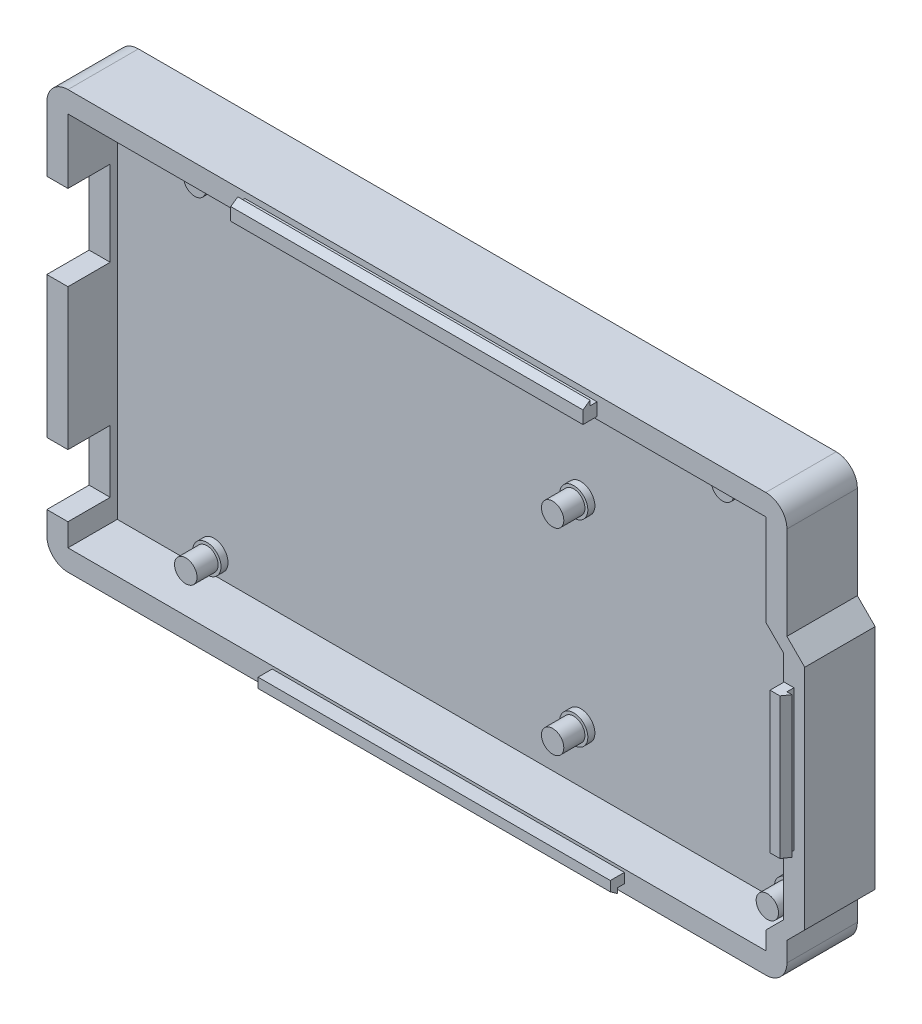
ISO-10303-21;
HEADER;
FILE_DESCRIPTION(('STEP AP214'),'2;1');
FILE_NAME('part.step','',(''),(''),'','','');
FILE_SCHEMA(('AUTOMOTIVE_DESIGN { 1 0 10303 214 1 1 1 1 }'));
ENDSEC;
DATA;
#1=APPLICATION_CONTEXT('core data for automotive mechanical design processes');
#2=APPLICATION_PROTOCOL_DEFINITION('international standard','automotive_design',2000,#1);
#3=PRODUCT_CONTEXT('',#1,'mechanical');
#4=PRODUCT('Part','Part','',(#3));
#5=PRODUCT_RELATED_PRODUCT_CATEGORY('part','',(#4));
#6=PRODUCT_DEFINITION_FORMATION('','',#4);
#7=PRODUCT_DEFINITION_CONTEXT('part definition',#1,'design');
#8=PRODUCT_DEFINITION('design','',#6,#7);
#9=PRODUCT_DEFINITION_SHAPE('','',#8);
#10=(LENGTH_UNIT() NAMED_UNIT(*) SI_UNIT(.MILLI.,.METRE.));
#11=(NAMED_UNIT(*) PLANE_ANGLE_UNIT() SI_UNIT($,.RADIAN.));
#12=(NAMED_UNIT(*) SI_UNIT($,.STERADIAN.) SOLID_ANGLE_UNIT());
#13=UNCERTAINTY_MEASURE_WITH_UNIT(LENGTH_MEASURE(1.E-05),#10,'distance_accuracy_value','');
#14=(GEOMETRIC_REPRESENTATION_CONTEXT(3) GLOBAL_UNCERTAINTY_ASSIGNED_CONTEXT((#13)) GLOBAL_UNIT_ASSIGNED_CONTEXT((#10,
#11,#12)) REPRESENTATION_CONTEXT('',''));
#15=CARTESIAN_POINT('',(0.,0.,0.));
#16=DIRECTION('',(0.,0.,1.));
#17=DIRECTION('',(1.,0.,0.));
#18=AXIS2_PLACEMENT_3D('',#15,#16,#17);
#19=CARTESIAN_POINT('',(0.,0.,0.));
#20=DIRECTION('',(0.,0.,1.));
#21=DIRECTION('',(1.,0.,0.));
#22=AXIS2_PLACEMENT_3D('',#19,#20,#21);
#23=PLANE('',#22);
#24=CARTESIAN_POINT('',(0.,0.,0.));
#25=DIRECTION('',(0.,0.,1.));
#26=DIRECTION('',(1.,0.,0.));
#27=AXIS2_PLACEMENT_3D('',#24,#25,#26);
#28=CIRCLE('',#27,2.99999999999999);
#29=CARTESIAN_POINT('',(0.,-3.,0.));
#30=VERTEX_POINT('',#29);
#31=CARTESIAN_POINT('',(-2.99999999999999,0.,0.));
#32=VERTEX_POINT('',#31);
#33=EDGE_CURVE('E480',#30,#32,#28,.F.);
#34=ORIENTED_EDGE('',*,*,#33,.T.);
#35=DIRECTION('',(0.,1.,0.));
#36=VECTOR('',#35,1.);
#37=CARTESIAN_POINT('',(-2.99999999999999,0.,0.));
#38=LINE('',#37,#36);
#39=CARTESIAN_POINT('',(-2.99999999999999,53.34,0.));
#40=VERTEX_POINT('',#39);
#41=EDGE_CURVE('E575',#32,#40,#38,.T.);
#42=ORIENTED_EDGE('',*,*,#41,.T.);
#43=CARTESIAN_POINT('',(0.,53.34,0.));
#44=DIRECTION('',(0.,0.,1.));
#45=DIRECTION('',(1.,0.,0.));
#46=AXIS2_PLACEMENT_3D('',#43,#44,#45);
#47=CIRCLE('',#46,2.99999999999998);
#48=CARTESIAN_POINT('',(0.,56.34,0.));
#49=VERTEX_POINT('',#48);
#50=EDGE_CURVE('E485',#40,#49,#47,.F.);
#51=ORIENTED_EDGE('',*,*,#50,.T.);
#52=DIRECTION('',(-1.,0.,0.));
#53=VECTOR('',#52,1.);
#54=CARTESIAN_POINT('',(0.,56.34,0.));
#55=LINE('',#54,#53);
#56=CARTESIAN_POINT('',(99.06,56.34,0.));
#57=VERTEX_POINT('',#56);
#58=EDGE_CURVE('E534',#57,#49,#55,.T.);
#59=ORIENTED_EDGE('',*,*,#58,.F.);
#60=CARTESIAN_POINT('',(99.06,53.34,0.));
#61=DIRECTION('',(0.,0.,1.));
#62=DIRECTION('',(1.,0.,0.));
#63=AXIS2_PLACEMENT_3D('',#60,#61,#62);
#64=CIRCLE('',#63,3.);
#65=CARTESIAN_POINT('',(102.06,53.34,0.));
#66=VERTEX_POINT('',#65);
#67=EDGE_CURVE('E532',#66,#57,#64,.T.);
#68=ORIENTED_EDGE('',*,*,#67,.F.);
#69=DIRECTION('',(0.,1.,0.));
#70=VECTOR('',#69,1.);
#71=CARTESIAN_POINT('',(102.06,0.,0.));
#72=LINE('',#71,#70);
#73=CARTESIAN_POINT('',(102.06,40.1463275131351,0.));
#74=VERTEX_POINT('',#73);
#75=EDGE_CURVE('E530',#74,#66,#72,.T.);
#76=ORIENTED_EDGE('',*,*,#75,.F.);
#77=DIRECTION('',(0.707106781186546,-0.707106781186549,0.));
#78=VECTOR('',#77,1.);
#79=CARTESIAN_POINT('',(71.1031637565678,71.1031637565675,0.));
#80=LINE('',#79,#78);
#81=CARTESIAN_POINT('',(104.591110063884,37.6152174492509,0.));
#82=VERTEX_POINT('',#81);
#83=EDGE_CURVE('E527',#74,#82,#80,.T.);
#84=ORIENTED_EDGE('',*,*,#83,.T.);
#85=DIRECTION('',(0.,1.,0.));
#86=VECTOR('',#85,1.);
#87=CARTESIAN_POINT('',(104.591110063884,0.,0.));
#88=LINE('',#87,#86);
#89=CARTESIAN_POINT('',(104.591110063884,5.31078255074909,0.));
#90=VERTEX_POINT('',#89);
#91=EDGE_CURVE('E524',#90,#82,#88,.T.);
#92=ORIENTED_EDGE('',*,*,#91,.F.);
#93=DIRECTION('',(0.707106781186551,0.707106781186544,0.));
#94=VECTOR('',#93,1.);
#95=CARTESIAN_POINT('',(49.6401637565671,-49.6401637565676,0.));
#96=LINE('',#95,#94);
#97=CARTESIAN_POINT('',(102.06,2.77967248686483,0.));
#98=VERTEX_POINT('',#97);
#99=EDGE_CURVE('E522',#98,#90,#96,.T.);
#100=ORIENTED_EDGE('',*,*,#99,.F.);
#101=DIRECTION('',(0.,1.,0.));
#102=VECTOR('',#101,1.);
#103=CARTESIAN_POINT('',(102.06,0.,0.));
#104=LINE('',#103,#102);
#105=CARTESIAN_POINT('',(102.06,0.,0.));
#106=VERTEX_POINT('',#105);
#107=EDGE_CURVE('E520',#106,#98,#104,.T.);
#108=ORIENTED_EDGE('',*,*,#107,.F.);
#109=CARTESIAN_POINT('',(99.06,0.,0.));
#110=DIRECTION('',(0.,0.,1.));
#111=DIRECTION('',(1.,0.,0.));
#112=AXIS2_PLACEMENT_3D('',#109,#110,#111);
#113=CIRCLE('',#112,3.);
#114=CARTESIAN_POINT('',(99.06,-3.,0.));
#115=VERTEX_POINT('',#114);
#116=EDGE_CURVE('E518',#115,#106,#113,.T.);
#117=ORIENTED_EDGE('',*,*,#116,.F.);
#118=DIRECTION('',(1.,0.,0.));
#119=VECTOR('',#118,1.);
#120=CARTESIAN_POINT('',(0.,-3.,0.));
#121=LINE('',#120,#119);
#122=EDGE_CURVE('E516',#30,#115,#121,.T.);
#123=ORIENTED_EDGE('',*,*,#122,.F.);
#124=EDGE_LOOP('',(#34,#42,#51,#59,#68,#76,#84,#92,#100,#108,#117,#123));
#125=FACE_BOUND('',#124,.T.);
#126=ADVANCED_FACE('F38',(#125),#23,.F.);
#127=CARTESIAN_POINT('',(0.,0.,3.));
#128=DIRECTION('',(0.,0.,1.));
#129=DIRECTION('',(1.,0.,0.));
#130=AXIS2_PLACEMENT_3D('',#127,#128,#129);
#131=PLANE('',#130);
#132=DIRECTION('',(-1.,0.,0.));
#133=VECTOR('',#132,1.);
#134=CARTESIAN_POINT('',(0.,53.34,3.));
#135=LINE('',#134,#133);
#136=CARTESIAN_POINT('',(99.06,53.34,3.));
#137=VERTEX_POINT('',#136);
#138=CARTESIAN_POINT('',(0.,53.34,3.));
#139=VERTEX_POINT('',#138);
#140=EDGE_CURVE('E722',#137,#139,#135,.T.);
#141=ORIENTED_EDGE('',*,*,#140,.T.);
#142=DIRECTION('',(0.,-1.,0.));
#143=VECTOR('',#142,1.);
#144=CARTESIAN_POINT('',(0.,0.,3.));
#145=LINE('',#144,#143);
#146=CARTESIAN_POINT('',(0.,0.,3.));
#147=VERTEX_POINT('',#146);
#148=EDGE_CURVE('E725',#139,#147,#145,.T.);
#149=ORIENTED_EDGE('',*,*,#148,.T.);
#150=DIRECTION('',(1.,0.,0.));
#151=VECTOR('',#150,1.);
#152=CARTESIAN_POINT('',(0.,0.,3.));
#153=LINE('',#152,#151);
#154=CARTESIAN_POINT('',(99.06,0.,3.));
#155=VERTEX_POINT('',#154);
#156=EDGE_CURVE('E727',#147,#155,#153,.T.);
#157=ORIENTED_EDGE('',*,*,#156,.T.);
#158=DIRECTION('',(0.,1.,0.));
#159=VECTOR('',#158,1.);
#160=CARTESIAN_POINT('',(99.06,0.,3.));
#161=LINE('',#160,#159);
#162=CARTESIAN_POINT('',(99.06,2.53999999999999,3.));
#163=VERTEX_POINT('',#162);
#164=EDGE_CURVE('E730',#155,#163,#161,.T.);
#165=ORIENTED_EDGE('',*,*,#164,.T.);
#166=DIRECTION('',(0.707106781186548,0.707106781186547,0.));
#167=VECTOR('',#166,1.);
#168=CARTESIAN_POINT('',(48.26,-48.26,3.));
#169=LINE('',#168,#167);
#170=CARTESIAN_POINT('',(101.6,5.07999999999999,3.));
#171=VERTEX_POINT('',#170);
#172=EDGE_CURVE('E733',#163,#171,#169,.T.);
#173=ORIENTED_EDGE('',*,*,#172,.T.);
#174=DIRECTION('',(0.,1.,0.));
#175=VECTOR('',#174,1.);
#176=CARTESIAN_POINT('',(101.6,0.,3.));
#177=LINE('',#176,#175);
#178=CARTESIAN_POINT('',(101.6,37.846,3.));
#179=VERTEX_POINT('',#178);
#180=EDGE_CURVE('E736',#171,#179,#177,.T.);
#181=ORIENTED_EDGE('',*,*,#180,.T.);
#182=DIRECTION('',(-0.707106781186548,0.707106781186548,0.));
#183=VECTOR('',#182,1.);
#184=CARTESIAN_POINT('',(69.723,69.723,3.));
#185=LINE('',#184,#183);
#186=CARTESIAN_POINT('',(99.06,40.386,3.));
#187=VERTEX_POINT('',#186);
#188=EDGE_CURVE('E739',#179,#187,#185,.T.);
#189=ORIENTED_EDGE('',*,*,#188,.T.);
#190=DIRECTION('',(0.,1.,0.));
#191=VECTOR('',#190,1.);
#192=CARTESIAN_POINT('',(99.06,0.,3.));
#193=LINE('',#192,#191);
#194=EDGE_CURVE('E742',#187,#137,#193,.T.);
#195=ORIENTED_EDGE('',*,*,#194,.T.);
#196=EDGE_LOOP('',(#141,#149,#157,#165,#173,#181,#189,#195));
#197=FACE_BOUND('',#196,.T.);
#198=CARTESIAN_POINT('',(89.9296534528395,50.8055939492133,3.));
#199=DIRECTION('',(0.,0.,1.));
#200=DIRECTION('',(1.,0.,0.));
#201=AXIS2_PLACEMENT_3D('',#198,#199,#200);
#202=CIRCLE('',#201,2.);
#203=CARTESIAN_POINT('',(91.9296534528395,50.8055939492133,3.));
#204=VERTEX_POINT('',#203);
#205=EDGE_CURVE('E745',#204,#204,#202,.T.);
#206=ORIENTED_EDGE('',*,*,#205,.F.);
#207=EDGE_LOOP('',(#206));
#208=FACE_BOUND('',#207,.T.);
#209=CARTESIAN_POINT('',(96.2803275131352,2.53999999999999,3.));
#210=DIRECTION('',(0.,0.,1.));
#211=DIRECTION('',(1.,0.,0.));
#212=AXIS2_PLACEMENT_3D('',#209,#210,#211);
#213=CIRCLE('',#212,2.);
#214=CARTESIAN_POINT('',(98.2803275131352,2.53999999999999,3.));
#215=VERTEX_POINT('',#214);
#216=EDGE_CURVE('E748',#215,#215,#213,.T.);
#217=ORIENTED_EDGE('',*,*,#216,.F.);
#218=EDGE_LOOP('',(#217));
#219=FACE_BOUND('',#218,.T.);
#220=CARTESIAN_POINT('',(65.8003275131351,35.56,3.));
#221=DIRECTION('',(0.,0.,1.));
#222=DIRECTION('',(1.,0.,0.));
#223=AXIS2_PLACEMENT_3D('',#220,#221,#222);
#224=CIRCLE('',#223,2.);
#225=CARTESIAN_POINT('',(67.8003275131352,35.56,3.));
#226=VERTEX_POINT('',#225);
#227=EDGE_CURVE('E751',#226,#226,#224,.T.);
#228=ORIENTED_EDGE('',*,*,#227,.F.);
#229=EDGE_LOOP('',(#228));
#230=FACE_BOUND('',#229,.T.);
#231=CARTESIAN_POINT('',(65.8003275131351,7.61999999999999,3.));
#232=DIRECTION('',(0.,0.,1.));
#233=DIRECTION('',(1.,0.,0.));
#234=AXIS2_PLACEMENT_3D('',#231,#232,#233);
#235=CIRCLE('',#234,2.);
#236=CARTESIAN_POINT('',(67.8003275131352,7.61999999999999,3.));
#237=VERTEX_POINT('',#236);
#238=EDGE_CURVE('E754',#237,#237,#235,.T.);
#239=ORIENTED_EDGE('',*,*,#238,.F.);
#240=EDGE_LOOP('',(#239));
#241=FACE_BOUND('',#240,.T.);
#242=CARTESIAN_POINT('',(15.0003385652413,50.7999985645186,3.));
#243=DIRECTION('',(0.,0.,1.));
#244=DIRECTION('',(1.,0.,0.));
#245=AXIS2_PLACEMENT_3D('',#242,#243,#244);
#246=CIRCLE('',#245,2.);
#247=CARTESIAN_POINT('',(17.0003385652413,50.7999985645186,3.));
#248=VERTEX_POINT('',#247);
#249=EDGE_CURVE('E45',#248,#248,#246,.T.);
#250=ORIENTED_EDGE('',*,*,#249,.F.);
#251=EDGE_LOOP('',(#250));
#252=FACE_BOUND('',#251,.T.);
#253=CARTESIAN_POINT('',(13.7231141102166,2.53540436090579,3.));
#254=DIRECTION('',(0.,0.,1.));
#255=DIRECTION('',(1.,0.,0.));
#256=AXIS2_PLACEMENT_3D('',#253,#254,#255);
#257=CIRCLE('',#256,2.0045294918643);
#258=CARTESIAN_POINT('',(15.7276436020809,2.53540436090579,3.));
#259=VERTEX_POINT('',#258);
#260=EDGE_CURVE('E11',#259,#259,#257,.T.);
#261=ORIENTED_EDGE('',*,*,#260,.F.);
#262=EDGE_LOOP('',(#261));
#263=FACE_BOUND('',#262,.T.);
#264=ADVANCED_FACE('F762',(#197,#208,#219,#230,#241,#252,#263),#131,.T.);
#265=CARTESIAN_POINT('',(0.,0.,10.));
#266=DIRECTION('',(1.,0.,0.));
#267=DIRECTION('',(0.,1.,0.));
#268=AXIS2_PLACEMENT_3D('',#265,#266,#267);
#269=PLANE('',#268);
#270=DIRECTION('',(0.,0.,-1.));
#271=VECTOR('',#270,1.);
#272=CARTESIAN_POINT('',(0.,0.,10.));
#273=LINE('',#272,#271);
#274=CARTESIAN_POINT('',(0.,0.,10.));
#275=VERTEX_POINT('',#274);
#276=EDGE_CURVE('E682',#275,#147,#273,.T.);
#277=ORIENTED_EDGE('',*,*,#276,.T.);
#278=ORIENTED_EDGE('',*,*,#148,.F.);
#279=DIRECTION('',(0.,0.,-1.));
#280=VECTOR('',#279,1.);
#281=CARTESIAN_POINT('',(0.,53.34,10.));
#282=LINE('',#281,#280);
#283=CARTESIAN_POINT('',(0.,53.34,10.));
#284=VERTEX_POINT('',#283);
#285=EDGE_CURVE('E703',#284,#139,#282,.T.);
#286=ORIENTED_EDGE('',*,*,#285,.F.);
#287=DIRECTION('',(0.,-1.,0.));
#288=VECTOR('',#287,1.);
#289=CARTESIAN_POINT('',(0.,0.,10.));
#290=LINE('',#289,#288);
#291=CARTESIAN_POINT('',(0.,44.1754600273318,10.));
#292=VERTEX_POINT('',#291);
#293=EDGE_CURVE('E650',#284,#292,#290,.T.);
#294=ORIENTED_EDGE('',*,*,#293,.T.);
#295=DIRECTION('',(0.,0.,-1.));
#296=VECTOR('',#295,1.);
#297=CARTESIAN_POINT('',(0.,44.1754600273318,10.));
#298=LINE('',#297,#296);
#299=CARTESIAN_POINT('',(0.,44.1754600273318,4.));
#300=VERTEX_POINT('',#299);
#301=EDGE_CURVE('E706',#292,#300,#298,.T.);
#302=ORIENTED_EDGE('',*,*,#301,.T.);
#303=DIRECTION('',(0.,-1.,0.));
#304=VECTOR('',#303,1.);
#305=CARTESIAN_POINT('',(0.,0.,4.));
#306=LINE('',#305,#304);
#307=CARTESIAN_POINT('',(0.,32.1047313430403,4.));
#308=VERTEX_POINT('',#307);
#309=EDGE_CURVE('E474',#300,#308,#306,.T.);
#310=ORIENTED_EDGE('',*,*,#309,.T.);
#311=DIRECTION('',(0.,0.,-1.));
#312=VECTOR('',#311,1.);
#313=CARTESIAN_POINT('',(0.,32.1047313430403,10.));
#314=LINE('',#313,#312);
#315=CARTESIAN_POINT('',(0.,32.1047313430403,10.));
#316=VERTEX_POINT('',#315);
#317=EDGE_CURVE('E717',#316,#308,#314,.T.);
#318=ORIENTED_EDGE('',*,*,#317,.F.);
#319=DIRECTION('',(0.,-1.,0.));
#320=VECTOR('',#319,1.);
#321=CARTESIAN_POINT('',(0.,0.,10.));
#322=LINE('',#321,#320);
#323=CARTESIAN_POINT('',(0.,12.0653179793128,10.));
#324=VERTEX_POINT('',#323);
#325=EDGE_CURVE('E714',#316,#324,#322,.T.);
#326=ORIENTED_EDGE('',*,*,#325,.T.);
#327=DIRECTION('',(0.,0.,-1.));
#328=VECTOR('',#327,1.);
#329=CARTESIAN_POINT('',(0.,12.0653179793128,10.));
#330=LINE('',#329,#328);
#331=CARTESIAN_POINT('',(0.,12.0653179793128,4.));
#332=VERTEX_POINT('',#331);
#333=EDGE_CURVE('E719',#324,#332,#330,.T.);
#334=ORIENTED_EDGE('',*,*,#333,.T.);
#335=DIRECTION('',(0.,-1.,0.));
#336=VECTOR('',#335,1.);
#337=CARTESIAN_POINT('',(0.,0.,4.));
#338=LINE('',#337,#336);
#339=CARTESIAN_POINT('',(0.,3.20854227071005,4.));
#340=VERTEX_POINT('',#339);
#341=EDGE_CURVE('E645',#332,#340,#338,.T.);
#342=ORIENTED_EDGE('',*,*,#341,.T.);
#343=DIRECTION('',(0.,0.,-1.));
#344=VECTOR('',#343,1.);
#345=CARTESIAN_POINT('',(0.,3.20854227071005,10.));
#346=LINE('',#345,#344);
#347=CARTESIAN_POINT('',(0.,3.20854227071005,10.));
#348=VERTEX_POINT('',#347);
#349=EDGE_CURVE('E679',#348,#340,#346,.T.);
#350=ORIENTED_EDGE('',*,*,#349,.F.);
#351=DIRECTION('',(0.,1.,0.));
#352=VECTOR('',#351,1.);
#353=CARTESIAN_POINT('',(0.,0.,10.));
#354=LINE('',#353,#352);
#355=EDGE_CURVE('E674',#275,#348,#354,.T.);
#356=ORIENTED_EDGE('',*,*,#355,.F.);
#357=EDGE_LOOP('',(#277,#278,#286,#294,#302,#310,#318,#326,#334,#342,#350,#356));
#358=FACE_BOUND('',#357,.T.);
#359=ADVANCED_FACE('F765',(#358),#269,.T.);
#360=CARTESIAN_POINT('',(0.,32.1047313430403,10.));
#361=DIRECTION('',(0.,1.,0.));
#362=DIRECTION('',(0.,0.,1.));
#363=AXIS2_PLACEMENT_3D('',#360,#361,#362);
#364=PLANE('',#363);
#365=DIRECTION('',(1.,0.,0.));
#366=VECTOR('',#365,1.);
#367=CARTESIAN_POINT('',(0.,32.1047313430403,4.));
#368=LINE('',#367,#366);
#369=CARTESIAN_POINT('',(-2.99999999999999,32.1047313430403,4.));
#370=VERTEX_POINT('',#369);
#371=EDGE_CURVE('E471',#370,#308,#368,.T.);
#372=ORIENTED_EDGE('',*,*,#371,.F.);
#373=DIRECTION('',(0.,0.,-1.));
#374=VECTOR('',#373,1.);
#375=CARTESIAN_POINT('',(-2.99999999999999,32.1047313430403,10.));
#376=LINE('',#375,#374);
#377=CARTESIAN_POINT('',(-2.99999999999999,32.1047313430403,10.));
#378=VERTEX_POINT('',#377);
#379=EDGE_CURVE('E583',#378,#370,#376,.T.);
#380=ORIENTED_EDGE('',*,*,#379,.F.);
#381=DIRECTION('',(1.,0.,0.));
#382=VECTOR('',#381,1.);
#383=CARTESIAN_POINT('',(0.,32.1047313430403,10.));
#384=LINE('',#383,#382);
#385=EDGE_CURVE('E709',#378,#316,#384,.T.);
#386=ORIENTED_EDGE('',*,*,#385,.T.);
#387=ORIENTED_EDGE('',*,*,#317,.T.);
#388=EDGE_LOOP('',(#372,#380,#386,#387));
#389=FACE_BOUND('',#388,.T.);
#390=ADVANCED_FACE('F946',(#389),#364,.T.);
#391=CARTESIAN_POINT('',(0.,12.0653179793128,10.));
#392=DIRECTION('',(0.,1.,0.));
#393=DIRECTION('',(0.,0.,1.));
#394=AXIS2_PLACEMENT_3D('',#391,#392,#393);
#395=PLANE('',#394);
#396=DIRECTION('',(0.,0.,-1.));
#397=VECTOR('',#396,1.);
#398=CARTESIAN_POINT('',(-2.99999999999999,12.0653179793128,10.));
#399=LINE('',#398,#397);
#400=CARTESIAN_POINT('',(-2.99999999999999,12.0653179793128,10.));
#401=VERTEX_POINT('',#400);
#402=CARTESIAN_POINT('',(-2.99999999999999,12.0653179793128,4.));
#403=VERTEX_POINT('',#402);
#404=EDGE_CURVE('E579',#401,#403,#399,.T.);
#405=ORIENTED_EDGE('',*,*,#404,.T.);
#406=DIRECTION('',(1.,0.,0.));
#407=VECTOR('',#406,1.);
#408=CARTESIAN_POINT('',(0.,12.0653179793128,4.));
#409=LINE('',#408,#407);
#410=EDGE_CURVE('E640',#403,#332,#409,.T.);
#411=ORIENTED_EDGE('',*,*,#410,.T.);
#412=ORIENTED_EDGE('',*,*,#333,.F.);
#413=DIRECTION('',(1.,0.,0.));
#414=VECTOR('',#413,1.);
#415=CARTESIAN_POINT('',(0.,12.0653179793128,10.));
#416=LINE('',#415,#414);
#417=EDGE_CURVE('E712',#401,#324,#416,.T.);
#418=ORIENTED_EDGE('',*,*,#417,.F.);
#419=EDGE_LOOP('',(#405,#411,#412,#418));
#420=FACE_BOUND('',#419,.T.);
#421=ADVANCED_FACE('F873',(#420),#395,.F.);
#422=CARTESIAN_POINT('',(0.,0.,10.));
#423=DIRECTION('',(0.,0.,1.));
#424=DIRECTION('',(1.,0.,0.));
#425=AXIS2_PLACEMENT_3D('',#422,#423,#424);
#426=PLANE('',#425);
#427=ORIENTED_EDGE('',*,*,#385,.F.);
#428=DIRECTION('',(0.,1.,0.));
#429=VECTOR('',#428,1.);
#430=CARTESIAN_POINT('',(-2.99999999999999,0.,10.));
#431=LINE('',#430,#429);
#432=EDGE_CURVE('E576',#401,#378,#431,.T.);
#433=ORIENTED_EDGE('',*,*,#432,.F.);
#434=ORIENTED_EDGE('',*,*,#417,.T.);
#435=ORIENTED_EDGE('',*,*,#325,.F.);
#436=EDGE_LOOP('',(#427,#433,#434,#435));
#437=FACE_BOUND('',#436,.T.);
#438=ADVANCED_FACE('F877',(#437),#426,.T.);
#439=CARTESIAN_POINT('',(0.,44.1754600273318,10.));
#440=DIRECTION('',(0.,-1.,0.));
#441=DIRECTION('',(0.,0.,-1.));
#442=AXIS2_PLACEMENT_3D('',#439,#440,#441);
#443=PLANE('',#442);
#444=DIRECTION('',(-1.,0.,0.));
#445=VECTOR('',#444,1.);
#446=CARTESIAN_POINT('',(0.,44.1754600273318,4.));
#447=LINE('',#446,#445);
#448=CARTESIAN_POINT('',(-2.99999999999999,44.1754600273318,4.));
#449=VERTEX_POINT('',#448);
#450=EDGE_CURVE('E465',#300,#449,#447,.T.);
#451=ORIENTED_EDGE('',*,*,#450,.F.);
#452=ORIENTED_EDGE('',*,*,#301,.F.);
#453=DIRECTION('',(-1.,0.,0.));
#454=VECTOR('',#453,1.);
#455=CARTESIAN_POINT('',(0.,44.1754600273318,10.));
#456=LINE('',#455,#454);
#457=CARTESIAN_POINT('',(-2.99999999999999,44.1754600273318,10.));
#458=VERTEX_POINT('',#457);
#459=EDGE_CURVE('E648',#292,#458,#456,.T.);
#460=ORIENTED_EDGE('',*,*,#459,.T.);
#461=DIRECTION('',(0.,0.,-1.));
#462=VECTOR('',#461,1.);
#463=CARTESIAN_POINT('',(-2.99999999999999,44.1754600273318,10.));
#464=LINE('',#463,#462);
#465=EDGE_CURVE('E544',#458,#449,#464,.T.);
#466=ORIENTED_EDGE('',*,*,#465,.T.);
#467=EDGE_LOOP('',(#451,#452,#460,#466));
#468=FACE_BOUND('',#467,.T.);
#469=ADVANCED_FACE('F885',(#468),#443,.T.);
#470=CARTESIAN_POINT('',(0.,53.34,10.));
#471=DIRECTION('',(0.,-1.,0.));
#472=DIRECTION('',(1.,0.,0.));
#473=AXIS2_PLACEMENT_3D('',#470,#471,#472);
#474=PLANE('',#473);
#475=ORIENTED_EDGE('',*,*,#285,.T.);
#476=ORIENTED_EDGE('',*,*,#140,.F.);
#477=DIRECTION('',(0.,0.,-1.));
#478=VECTOR('',#477,1.);
#479=CARTESIAN_POINT('',(99.06,53.34,10.));
#480=LINE('',#479,#478);
#481=CARTESIAN_POINT('',(99.06,53.34,10.));
#482=VERTEX_POINT('',#481);
#483=EDGE_CURVE('E700',#482,#137,#480,.T.);
#484=ORIENTED_EDGE('',*,*,#483,.F.);
#485=DIRECTION('',(-1.,0.,0.));
#486=VECTOR('',#485,1.);
#487=CARTESIAN_POINT('',(0.,53.34,10.));
#488=LINE('',#487,#486);
#489=EDGE_CURVE('E653',#482,#284,#488,.T.);
#490=ORIENTED_EDGE('',*,*,#489,.T.);
#491=EDGE_LOOP('',(#475,#476,#484,#490));
#492=FACE_BOUND('',#491,.T.);
#493=ADVANCED_FACE('F892',(#492),#474,.T.);
#494=CARTESIAN_POINT('',(99.06,0.,10.));
#495=DIRECTION('',(-1.,0.,0.));
#496=DIRECTION('',(0.,0.,1.));
#497=AXIS2_PLACEMENT_3D('',#494,#495,#496);
#498=PLANE('',#497);
#499=ORIENTED_EDGE('',*,*,#483,.T.);
#500=ORIENTED_EDGE('',*,*,#194,.F.);
#501=DIRECTION('',(0.,0.,-1.));
#502=VECTOR('',#501,1.);
#503=CARTESIAN_POINT('',(99.06,40.386,10.));
#504=LINE('',#503,#502);
#505=CARTESIAN_POINT('',(99.06,40.386,10.));
#506=VERTEX_POINT('',#505);
#507=EDGE_CURVE('E697',#506,#187,#504,.T.);
#508=ORIENTED_EDGE('',*,*,#507,.F.);
#509=DIRECTION('',(0.,1.,0.));
#510=VECTOR('',#509,1.);
#511=CARTESIAN_POINT('',(99.06,0.,10.));
#512=LINE('',#511,#510);
#513=EDGE_CURVE('E656',#506,#482,#512,.T.);
#514=ORIENTED_EDGE('',*,*,#513,.T.);
#515=EDGE_LOOP('',(#499,#500,#508,#514));
#516=FACE_BOUND('',#515,.T.);
#517=ADVANCED_FACE('F894',(#516),#498,.T.);
#518=CARTESIAN_POINT('',(69.723,69.723,10.));
#519=DIRECTION('',(-0.707106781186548,-0.707106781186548,0.));
#520=DIRECTION('',(0.707106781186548,-0.707106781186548,0.));
#521=AXIS2_PLACEMENT_3D('',#518,#519,#520);
#522=PLANE('',#521);
#523=ORIENTED_EDGE('',*,*,#507,.T.);
#524=ORIENTED_EDGE('',*,*,#188,.F.);
#525=DIRECTION('',(0.,0.,-1.));
#526=VECTOR('',#525,1.);
#527=CARTESIAN_POINT('',(101.6,37.846,10.));
#528=LINE('',#527,#526);
#529=CARTESIAN_POINT('',(101.6,37.846,10.));
#530=VERTEX_POINT('',#529);
#531=EDGE_CURVE('E694',#530,#179,#528,.T.);
#532=ORIENTED_EDGE('',*,*,#531,.F.);
#533=DIRECTION('',(-0.707106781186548,0.707106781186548,0.));
#534=VECTOR('',#533,1.);
#535=CARTESIAN_POINT('',(69.723,69.723,10.));
#536=LINE('',#535,#534);
#537=EDGE_CURVE('E659',#530,#506,#536,.T.);
#538=ORIENTED_EDGE('',*,*,#537,.T.);
#539=EDGE_LOOP('',(#523,#524,#532,#538));
#540=FACE_BOUND('',#539,.T.);
#541=ADVANCED_FACE('F897',(#540),#522,.T.);
#542=CARTESIAN_POINT('',(101.6,0.,10.));
#543=DIRECTION('',(-1.,0.,0.));
#544=DIRECTION('',(0.,0.,1.));
#545=AXIS2_PLACEMENT_3D('',#542,#543,#544);
#546=PLANE('',#545);
#547=ORIENTED_EDGE('',*,*,#531,.T.);
#548=ORIENTED_EDGE('',*,*,#180,.F.);
#549=DIRECTION('',(0.,0.,-1.));
#550=VECTOR('',#549,1.);
#551=CARTESIAN_POINT('',(101.6,5.07999999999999,10.));
#552=LINE('',#551,#550);
#553=CARTESIAN_POINT('',(101.6,5.07999999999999,10.));
#554=VERTEX_POINT('',#553);
#555=EDGE_CURVE('E691',#554,#171,#552,.T.);
#556=ORIENTED_EDGE('',*,*,#555,.F.);
#557=DIRECTION('',(0.,1.,0.));
#558=VECTOR('',#557,1.);
#559=CARTESIAN_POINT('',(101.6,0.,10.));
#560=LINE('',#559,#558);
#561=EDGE_CURVE('E662',#554,#530,#560,.T.);
#562=ORIENTED_EDGE('',*,*,#561,.T.);
#563=EDGE_LOOP('',(#547,#548,#556,#562));
#564=FACE_BOUND('',#563,.T.);
#565=ADVANCED_FACE('F900',(#564),#546,.T.);
#566=CARTESIAN_POINT('',(48.26,-48.26,10.));
#567=DIRECTION('',(-0.707106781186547,0.707106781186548,0.));
#568=DIRECTION('',(-0.707106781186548,-0.707106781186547,0.));
#569=AXIS2_PLACEMENT_3D('',#566,#567,#568);
#570=PLANE('',#569);
#571=ORIENTED_EDGE('',*,*,#555,.T.);
#572=ORIENTED_EDGE('',*,*,#172,.F.);
#573=DIRECTION('',(0.,0.,-1.));
#574=VECTOR('',#573,1.);
#575=CARTESIAN_POINT('',(99.06,2.53999999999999,10.));
#576=LINE('',#575,#574);
#577=CARTESIAN_POINT('',(99.06,2.53999999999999,10.));
#578=VERTEX_POINT('',#577);
#579=EDGE_CURVE('E688',#578,#163,#576,.T.);
#580=ORIENTED_EDGE('',*,*,#579,.F.);
#581=DIRECTION('',(0.707106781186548,0.707106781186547,0.));
#582=VECTOR('',#581,1.);
#583=CARTESIAN_POINT('',(48.26,-48.26,10.));
#584=LINE('',#583,#582);
#585=EDGE_CURVE('E665',#578,#554,#584,.T.);
#586=ORIENTED_EDGE('',*,*,#585,.T.);
#587=EDGE_LOOP('',(#571,#572,#580,#586));
#588=FACE_BOUND('',#587,.T.);
#589=ADVANCED_FACE('F905',(#588),#570,.T.);
#590=CARTESIAN_POINT('',(99.06,0.,10.));
#591=DIRECTION('',(-1.,0.,0.));
#592=DIRECTION('',(0.,0.,1.));
#593=AXIS2_PLACEMENT_3D('',#590,#591,#592);
#594=PLANE('',#593);
#595=ORIENTED_EDGE('',*,*,#579,.T.);
#596=ORIENTED_EDGE('',*,*,#164,.F.);
#597=DIRECTION('',(0.,0.,-1.));
#598=VECTOR('',#597,1.);
#599=CARTESIAN_POINT('',(99.06,0.,10.));
#600=LINE('',#599,#598);
#601=CARTESIAN_POINT('',(99.06,0.,10.));
#602=VERTEX_POINT('',#601);
#603=EDGE_CURVE('E685',#602,#155,#600,.T.);
#604=ORIENTED_EDGE('',*,*,#603,.F.);
#605=DIRECTION('',(0.,1.,0.));
#606=VECTOR('',#605,1.);
#607=CARTESIAN_POINT('',(99.06,0.,10.));
#608=LINE('',#607,#606);
#609=EDGE_CURVE('E668',#602,#578,#608,.T.);
#610=ORIENTED_EDGE('',*,*,#609,.T.);
#611=EDGE_LOOP('',(#595,#596,#604,#610));
#612=FACE_BOUND('',#611,.T.);
#613=ADVANCED_FACE('F907',(#612),#594,.T.);
#614=CARTESIAN_POINT('',(0.,0.,10.));
#615=DIRECTION('',(0.,1.,0.));
#616=DIRECTION('',(-1.,0.,0.));
#617=AXIS2_PLACEMENT_3D('',#614,#615,#616);
#618=PLANE('',#617);
#619=ORIENTED_EDGE('',*,*,#603,.T.);
#620=ORIENTED_EDGE('',*,*,#156,.F.);
#621=ORIENTED_EDGE('',*,*,#276,.F.);
#622=DIRECTION('',(1.,0.,0.));
#623=VECTOR('',#622,1.);
#624=CARTESIAN_POINT('',(0.,0.,10.));
#625=LINE('',#624,#623);
#626=EDGE_CURVE('E671',#275,#602,#625,.T.);
#627=ORIENTED_EDGE('',*,*,#626,.T.);
#628=EDGE_LOOP('',(#619,#620,#621,#627));
#629=FACE_BOUND('',#628,.T.);
#630=ADVANCED_FACE('F910',(#629),#618,.T.);
#631=CARTESIAN_POINT('',(0.,3.20854227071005,10.));
#632=DIRECTION('',(0.,1.,0.));
#633=DIRECTION('',(0.,0.,1.));
#634=AXIS2_PLACEMENT_3D('',#631,#632,#633);
#635=PLANE('',#634);
#636=DIRECTION('',(1.,0.,0.));
#637=VECTOR('',#636,1.);
#638=CARTESIAN_POINT('',(0.,3.20854227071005,4.));
#639=LINE('',#638,#637);
#640=CARTESIAN_POINT('',(-2.99999999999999,3.20854227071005,4.));
#641=VERTEX_POINT('',#640);
#642=EDGE_CURVE('E643',#641,#340,#639,.T.);
#643=ORIENTED_EDGE('',*,*,#642,.F.);
#644=DIRECTION('',(0.,0.,-1.));
#645=VECTOR('',#644,1.);
#646=CARTESIAN_POINT('',(-2.99999999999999,3.20854227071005,10.));
#647=LINE('',#646,#645);
#648=CARTESIAN_POINT('',(-2.99999999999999,3.20854227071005,10.));
#649=VERTEX_POINT('',#648);
#650=EDGE_CURVE('E541',#649,#641,#647,.T.);
#651=ORIENTED_EDGE('',*,*,#650,.F.);
#652=DIRECTION('',(1.,0.,0.));
#653=VECTOR('',#652,1.);
#654=CARTESIAN_POINT('',(0.,3.20854227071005,10.));
#655=LINE('',#654,#653);
#656=EDGE_CURVE('E676',#649,#348,#655,.T.);
#657=ORIENTED_EDGE('',*,*,#656,.T.);
#658=ORIENTED_EDGE('',*,*,#349,.T.);
#659=EDGE_LOOP('',(#643,#651,#657,#658));
#660=FACE_BOUND('',#659,.T.);
#661=ADVANCED_FACE('F867',(#660),#635,.T.);
#662=CARTESIAN_POINT('',(0.,0.,10.));
#663=DIRECTION('',(0.,0.,1.));
#664=DIRECTION('',(1.,0.,0.));
#665=AXIS2_PLACEMENT_3D('',#662,#663,#664);
#666=PLANE('',#665);
#667=DIRECTION('',(0.,-1.,0.));
#668=VECTOR('',#667,1.);
#669=CARTESIAN_POINT('',(78.9932847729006,-0.400700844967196,10.));
#670=LINE('',#669,#668);
#671=CARTESIAN_POINT('',(78.9932847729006,-0.400700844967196,10.));
#672=VERTEX_POINT('',#671);
#673=CARTESIAN_POINT('',(78.9932847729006,-1.8007008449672,10.));
#674=VERTEX_POINT('',#673);
#675=EDGE_CURVE('E325',#672,#674,#670,.T.);
#676=ORIENTED_EDGE('',*,*,#675,.T.);
#677=DIRECTION('',(-1.,0.,0.));
#678=VECTOR('',#677,1.);
#679=CARTESIAN_POINT('',(53.9932847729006,-1.8007008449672,10.));
#680=LINE('',#679,#678);
#681=CARTESIAN_POINT('',(28.9932847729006,-1.8007008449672,10.));
#682=VERTEX_POINT('',#681);
#683=EDGE_CURVE('E329',#674,#682,#680,.T.);
#684=ORIENTED_EDGE('',*,*,#683,.T.);
#685=DIRECTION('',(0.,1.,0.));
#686=VECTOR('',#685,1.);
#687=CARTESIAN_POINT('',(28.9932847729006,-0.400700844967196,10.));
#688=LINE('',#687,#686);
#689=CARTESIAN_POINT('',(28.9932847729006,-0.400700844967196,10.));
#690=VERTEX_POINT('',#689);
#691=EDGE_CURVE('E57',#682,#690,#688,.T.);
#692=ORIENTED_EDGE('',*,*,#691,.T.);
#693=DIRECTION('',(1.,0.,0.));
#694=VECTOR('',#693,1.);
#695=CARTESIAN_POINT('',(53.9932847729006,-0.400700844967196,10.));
#696=LINE('',#695,#694);
#697=EDGE_CURVE('E52',#690,#672,#696,.T.);
#698=ORIENTED_EDGE('',*,*,#697,.T.);
#699=EDGE_LOOP('',(#676,#684,#692,#698));
#700=FACE_BOUND('',#699,.T.);
#701=DIRECTION('',(-1.,0.,0.));
#702=VECTOR('',#701,1.);
#703=CARTESIAN_POINT('',(101.664137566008,14.3336039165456,10.));
#704=LINE('',#703,#702);
#705=CARTESIAN_POINT('',(103.064137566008,14.3336039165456,10.));
#706=VERTEX_POINT('',#705);
#707=CARTESIAN_POINT('',(101.664137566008,14.3336039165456,10.));
#708=VERTEX_POINT('',#707);
#709=EDGE_CURVE('E400',#706,#708,#704,.T.);
#710=ORIENTED_EDGE('',*,*,#709,.T.);
#711=DIRECTION('',(0.,1.,0.));
#712=VECTOR('',#711,1.);
#713=CARTESIAN_POINT('',(101.664137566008,24.3336039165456,10.));
#714=LINE('',#713,#712);
#715=CARTESIAN_POINT('',(101.664137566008,34.3336039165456,10.));
#716=VERTEX_POINT('',#715);
#717=EDGE_CURVE('E333',#708,#716,#714,.T.);
#718=ORIENTED_EDGE('',*,*,#717,.T.);
#719=DIRECTION('',(1.,0.,0.));
#720=VECTOR('',#719,1.);
#721=CARTESIAN_POINT('',(101.664137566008,34.3336039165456,10.));
#722=LINE('',#721,#720);
#723=CARTESIAN_POINT('',(103.064137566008,34.3336039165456,10.));
#724=VERTEX_POINT('',#723);
#725=EDGE_CURVE('E375',#716,#724,#722,.T.);
#726=ORIENTED_EDGE('',*,*,#725,.T.);
#727=DIRECTION('',(0.,-1.,0.));
#728=VECTOR('',#727,1.);
#729=CARTESIAN_POINT('',(103.064137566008,24.3336039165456,10.));
#730=LINE('',#729,#728);
#731=EDGE_CURVE('E377',#724,#706,#730,.T.);
#732=ORIENTED_EDGE('',*,*,#731,.T.);
#733=EDGE_LOOP('',(#710,#718,#726,#732));
#734=FACE_BOUND('',#733,.T.);
#735=DIRECTION('',(0.,-1.,0.));
#736=VECTOR('',#735,1.);
#737=CARTESIAN_POINT('',(75.1087087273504,53.7065431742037,10.));
#738=LINE('',#737,#736);
#739=CARTESIAN_POINT('',(75.1087087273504,55.5065431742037,10.));
#740=VERTEX_POINT('',#739);
#741=CARTESIAN_POINT('',(75.1087087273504,53.7065431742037,10.));
#742=VERTEX_POINT('',#741);
#743=EDGE_CURVE('E446',#740,#742,#738,.T.);
#744=ORIENTED_EDGE('',*,*,#743,.T.);
#745=DIRECTION('',(-1.,0.,0.));
#746=VECTOR('',#745,1.);
#747=CARTESIAN_POINT('',(50.1087087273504,53.7065431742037,10.));
#748=LINE('',#747,#746);
#749=CARTESIAN_POINT('',(25.1087087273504,53.7065431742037,10.));
#750=VERTEX_POINT('',#749);
#751=EDGE_CURVE('E419',#742,#750,#748,.T.);
#752=ORIENTED_EDGE('',*,*,#751,.T.);
#753=DIRECTION('',(0.,1.,0.));
#754=VECTOR('',#753,1.);
#755=CARTESIAN_POINT('',(25.1087087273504,53.7065431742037,10.));
#756=LINE('',#755,#754);
#757=CARTESIAN_POINT('',(25.1087087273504,55.5065431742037,10.));
#758=VERTEX_POINT('',#757);
#759=EDGE_CURVE('E421',#750,#758,#756,.T.);
#760=ORIENTED_EDGE('',*,*,#759,.T.);
#761=DIRECTION('',(1.,0.,0.));
#762=VECTOR('',#761,1.);
#763=CARTESIAN_POINT('',(50.1087087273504,55.5065431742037,10.));
#764=LINE('',#763,#762);
#765=EDGE_CURVE('E423',#758,#740,#764,.T.);
#766=ORIENTED_EDGE('',*,*,#765,.T.);
#767=EDGE_LOOP('',(#744,#752,#760,#766));
#768=FACE_BOUND('',#767,.T.);
#769=DIRECTION('',(0.,1.,0.));
#770=VECTOR('',#769,1.);
#771=CARTESIAN_POINT('',(-2.99999999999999,0.,10.));
#772=LINE('',#771,#770);
#773=CARTESIAN_POINT('',(-2.99999999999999,53.34,10.));
#774=VERTEX_POINT('',#773);
#775=EDGE_CURVE('E507',#458,#774,#772,.T.);
#776=ORIENTED_EDGE('',*,*,#775,.F.);
#777=ORIENTED_EDGE('',*,*,#459,.F.);
#778=ORIENTED_EDGE('',*,*,#293,.F.);
#779=ORIENTED_EDGE('',*,*,#489,.F.);
#780=ORIENTED_EDGE('',*,*,#513,.F.);
#781=ORIENTED_EDGE('',*,*,#537,.F.);
#782=ORIENTED_EDGE('',*,*,#561,.F.);
#783=ORIENTED_EDGE('',*,*,#585,.F.);
#784=ORIENTED_EDGE('',*,*,#609,.F.);
#785=ORIENTED_EDGE('',*,*,#626,.F.);
#786=ORIENTED_EDGE('',*,*,#355,.T.);
#787=ORIENTED_EDGE('',*,*,#656,.F.);
#788=DIRECTION('',(0.,1.,0.));
#789=VECTOR('',#788,1.);
#790=CARTESIAN_POINT('',(-2.99999999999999,0.,10.));
#791=LINE('',#790,#789);
#792=CARTESIAN_POINT('',(-2.99999999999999,0.,10.));
#793=VERTEX_POINT('',#792);
#794=EDGE_CURVE('E510',#793,#649,#791,.T.);
#795=ORIENTED_EDGE('',*,*,#794,.F.);
#796=CARTESIAN_POINT('',(0.,0.,10.));
#797=DIRECTION('',(0.,0.,1.));
#798=DIRECTION('',(1.,0.,0.));
#799=AXIS2_PLACEMENT_3D('',#796,#797,#798);
#800=CIRCLE('',#799,2.99999999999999);
#801=CARTESIAN_POINT('',(0.,-3.,10.));
#802=VERTEX_POINT('',#801);
#803=EDGE_CURVE('E481',#802,#793,#800,.F.);
#804=ORIENTED_EDGE('',*,*,#803,.F.);
#805=DIRECTION('',(1.,0.,0.));
#806=VECTOR('',#805,1.);
#807=CARTESIAN_POINT('',(0.,-3.,10.));
#808=LINE('',#807,#806);
#809=CARTESIAN_POINT('',(99.06,-3.,10.));
#810=VERTEX_POINT('',#809);
#811=EDGE_CURVE('E484',#802,#810,#808,.T.);
#812=ORIENTED_EDGE('',*,*,#811,.T.);
#813=CARTESIAN_POINT('',(99.06,0.,10.));
#814=DIRECTION('',(0.,0.,1.));
#815=DIRECTION('',(1.,0.,0.));
#816=AXIS2_PLACEMENT_3D('',#813,#814,#815);
#817=CIRCLE('',#816,3.);
#818=CARTESIAN_POINT('',(102.06,0.,10.));
#819=VERTEX_POINT('',#818);
#820=EDGE_CURVE('E487',#810,#819,#817,.T.);
#821=ORIENTED_EDGE('',*,*,#820,.T.);
#822=DIRECTION('',(0.,1.,0.));
#823=VECTOR('',#822,1.);
#824=CARTESIAN_POINT('',(102.06,0.,10.));
#825=LINE('',#824,#823);
#826=CARTESIAN_POINT('',(102.06,2.77967248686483,10.));
#827=VERTEX_POINT('',#826);
#828=EDGE_CURVE('E489',#819,#827,#825,.T.);
#829=ORIENTED_EDGE('',*,*,#828,.T.);
#830=DIRECTION('',(0.707106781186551,0.707106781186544,0.));
#831=VECTOR('',#830,1.);
#832=CARTESIAN_POINT('',(49.6401637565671,-49.6401637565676,10.));
#833=LINE('',#832,#831);
#834=CARTESIAN_POINT('',(104.591110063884,5.31078255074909,10.));
#835=VERTEX_POINT('',#834);
#836=EDGE_CURVE('E491',#827,#835,#833,.T.);
#837=ORIENTED_EDGE('',*,*,#836,.T.);
#838=DIRECTION('',(0.,1.,0.));
#839=VECTOR('',#838,1.);
#840=CARTESIAN_POINT('',(104.591110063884,0.,10.));
#841=LINE('',#840,#839);
#842=CARTESIAN_POINT('',(104.591110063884,37.6152174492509,10.));
#843=VERTEX_POINT('',#842);
#844=EDGE_CURVE('E493',#835,#843,#841,.T.);
#845=ORIENTED_EDGE('',*,*,#844,.T.);
#846=DIRECTION('',(0.707106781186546,-0.707106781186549,0.));
#847=VECTOR('',#846,1.);
#848=CARTESIAN_POINT('',(71.1031637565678,71.1031637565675,10.));
#849=LINE('',#848,#847);
#850=CARTESIAN_POINT('',(102.06,40.1463275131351,10.));
#851=VERTEX_POINT('',#850);
#852=EDGE_CURVE('E495',#851,#843,#849,.T.);
#853=ORIENTED_EDGE('',*,*,#852,.F.);
#854=DIRECTION('',(0.,1.,0.));
#855=VECTOR('',#854,1.);
#856=CARTESIAN_POINT('',(102.06,0.,10.));
#857=LINE('',#856,#855);
#858=CARTESIAN_POINT('',(102.06,53.34,10.));
#859=VERTEX_POINT('',#858);
#860=EDGE_CURVE('E498',#851,#859,#857,.T.);
#861=ORIENTED_EDGE('',*,*,#860,.T.);
#862=CARTESIAN_POINT('',(99.06,53.34,10.));
#863=DIRECTION('',(0.,0.,1.));
#864=DIRECTION('',(1.,0.,0.));
#865=AXIS2_PLACEMENT_3D('',#862,#863,#864);
#866=CIRCLE('',#865,3.);
#867=CARTESIAN_POINT('',(99.06,56.34,10.));
#868=VERTEX_POINT('',#867);
#869=EDGE_CURVE('E500',#859,#868,#866,.T.);
#870=ORIENTED_EDGE('',*,*,#869,.T.);
#871=DIRECTION('',(-1.,0.,0.));
#872=VECTOR('',#871,1.);
#873=CARTESIAN_POINT('',(0.,56.34,10.));
#874=LINE('',#873,#872);
#875=CARTESIAN_POINT('',(0.,56.34,10.));
#876=VERTEX_POINT('',#875);
#877=EDGE_CURVE('E502',#868,#876,#874,.T.);
#878=ORIENTED_EDGE('',*,*,#877,.T.);
#879=CARTESIAN_POINT('',(0.,53.34,10.));
#880=DIRECTION('',(0.,0.,1.));
#881=DIRECTION('',(1.,0.,0.));
#882=AXIS2_PLACEMENT_3D('',#879,#880,#881);
#883=CIRCLE('',#882,2.99999999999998);
#884=EDGE_CURVE('E504',#774,#876,#883,.F.);
#885=ORIENTED_EDGE('',*,*,#884,.F.);
#886=EDGE_LOOP('',(#776,#777,#778,#779,#780,#781,#782,#783,#784,#785,#786,#787,#795,#804,#812,
#821,#829,#837,#845,#853,#861,#870,#878,#885));
#887=FACE_BOUND('',#886,.T.);
#888=ADVANCED_FACE('F327',(#700,#734,#768,#887),#666,.T.);
#889=CARTESIAN_POINT('',(0.,0.,4.));
#890=DIRECTION('',(0.,0.,1.));
#891=DIRECTION('',(1.,0.,0.));
#892=AXIS2_PLACEMENT_3D('',#889,#890,#891);
#893=PLANE('',#892);
#894=ORIENTED_EDGE('',*,*,#410,.F.);
#895=DIRECTION('',(0.,1.,0.));
#896=VECTOR('',#895,1.);
#897=CARTESIAN_POINT('',(-2.99999999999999,0.,4.));
#898=LINE('',#897,#896);
#899=EDGE_CURVE('E477',#641,#403,#898,.T.);
#900=ORIENTED_EDGE('',*,*,#899,.F.);
#901=ORIENTED_EDGE('',*,*,#642,.T.);
#902=ORIENTED_EDGE('',*,*,#341,.F.);
#903=EDGE_LOOP('',(#894,#900,#901,#902));
#904=FACE_BOUND('',#903,.T.);
#905=ADVANCED_FACE('F911',(#904),#893,.T.);
#906=CARTESIAN_POINT('',(15.0003385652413,50.7999985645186,4.));
#907=DIRECTION('',(0.,0.,1.));
#908=DIRECTION('',(1.,0.,0.));
#909=AXIS2_PLACEMENT_3D('',#906,#907,#908);
#910=PLANE('',#909);
#911=CARTESIAN_POINT('',(15.0003385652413,50.7999985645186,4.));
#912=DIRECTION('',(0.,0.,1.));
#913=DIRECTION('',(1.,0.,0.));
#914=AXIS2_PLACEMENT_3D('',#911,#912,#913);
#915=CIRCLE('',#914,2.);
#916=CARTESIAN_POINT('',(17.0003385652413,50.7999985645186,4.));
#917=VERTEX_POINT('',#916);
#918=EDGE_CURVE('E634',#917,#917,#915,.T.);
#919=ORIENTED_EDGE('',*,*,#918,.T.);
#920=EDGE_LOOP('',(#919));
#921=FACE_BOUND('',#920,.T.);
#922=CARTESIAN_POINT('',(15.0003385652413,50.7999985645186,4.));
#923=DIRECTION('',(0.,0.,1.));
#924=DIRECTION('',(1.,0.,0.));
#925=AXIS2_PLACEMENT_3D('',#922,#923,#924);
#926=CIRCLE('',#925,1.58751114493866);
#927=CARTESIAN_POINT('',(16.58784971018,50.7999985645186,4.));
#928=VERTEX_POINT('',#927);
#929=EDGE_CURVE('E637',#928,#928,#926,.T.);
#930=ORIENTED_EDGE('',*,*,#929,.F.);
#931=EDGE_LOOP('',(#930));
#932=FACE_BOUND('',#931,.T.);
#933=ADVANCED_FACE('F913',(#921,#932),#910,.T.);
#934=CARTESIAN_POINT('',(15.0003385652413,50.7999985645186,4.));
#935=DIRECTION('',(0.,0.,-1.));
#936=DIRECTION('',(-1.,0.,0.));
#937=AXIS2_PLACEMENT_3D('',#934,#935,#936);
#938=CYLINDRICAL_SURFACE('',#937,2.);
#939=ORIENTED_EDGE('',*,*,#249,.T.);
#940=EDGE_LOOP('',(#939));
#941=FACE_BOUND('',#940,.T.);
#942=ORIENTED_EDGE('',*,*,#918,.F.);
#943=EDGE_LOOP('',(#942));
#944=FACE_BOUND('',#943,.T.);
#945=ADVANCED_FACE('F759',(#941,#944),#938,.T.);
#946=CARTESIAN_POINT('',(65.8003275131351,35.56,4.));
#947=DIRECTION('',(0.,0.,1.));
#948=DIRECTION('',(1.,0.,0.));
#949=AXIS2_PLACEMENT_3D('',#946,#947,#948);
#950=PLANE('',#949);
#951=CARTESIAN_POINT('',(65.8003275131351,35.56,4.));
#952=DIRECTION('',(0.,0.,1.));
#953=DIRECTION('',(1.,0.,0.));
#954=AXIS2_PLACEMENT_3D('',#951,#952,#953);
#955=CIRCLE('',#954,2.);
#956=CARTESIAN_POINT('',(67.8003275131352,35.56,4.));
#957=VERTEX_POINT('',#956);
#958=EDGE_CURVE('E628',#957,#957,#955,.T.);
#959=ORIENTED_EDGE('',*,*,#958,.T.);
#960=EDGE_LOOP('',(#959));
#961=FACE_BOUND('',#960,.T.);
#962=CARTESIAN_POINT('',(65.8003275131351,35.56,4.));
#963=DIRECTION('',(0.,0.,1.));
#964=DIRECTION('',(1.,0.,0.));
#965=AXIS2_PLACEMENT_3D('',#962,#963,#964);
#966=CIRCLE('',#965,1.5875);
#967=CARTESIAN_POINT('',(67.3878275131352,35.56,4.));
#968=VERTEX_POINT('',#967);
#969=EDGE_CURVE('E631',#968,#968,#966,.T.);
#970=ORIENTED_EDGE('',*,*,#969,.F.);
#971=EDGE_LOOP('',(#970));
#972=FACE_BOUND('',#971,.T.);
#973=ADVANCED_FACE('F1043',(#961,#972),#950,.T.);
#974=CARTESIAN_POINT('',(65.8003275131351,35.56,4.));
#975=DIRECTION('',(0.,0.,-1.));
#976=DIRECTION('',(-1.,0.,0.));
#977=AXIS2_PLACEMENT_3D('',#974,#975,#976);
#978=CYLINDRICAL_SURFACE('',#977,2.);
#979=ORIENTED_EDGE('',*,*,#227,.T.);
#980=EDGE_LOOP('',(#979));
#981=FACE_BOUND('',#980,.T.);
#982=ORIENTED_EDGE('',*,*,#958,.F.);
#983=EDGE_LOOP('',(#982));
#984=FACE_BOUND('',#983,.T.);
#985=ADVANCED_FACE('F1051',(#981,#984),#978,.T.);
#986=CARTESIAN_POINT('',(89.9296534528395,50.8055939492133,4.));
#987=DIRECTION('',(0.,0.,1.));
#988=DIRECTION('',(1.,0.,0.));
#989=AXIS2_PLACEMENT_3D('',#986,#987,#988);
#990=PLANE('',#989);
#991=CARTESIAN_POINT('',(89.9296534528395,50.8055939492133,4.));
#992=DIRECTION('',(0.,0.,1.));
#993=DIRECTION('',(1.,0.,0.));
#994=AXIS2_PLACEMENT_3D('',#991,#992,#993);
#995=CIRCLE('',#994,2.);
#996=CARTESIAN_POINT('',(91.9296534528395,50.8055939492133,4.));
#997=VERTEX_POINT('',#996);
#998=EDGE_CURVE('E622',#997,#997,#995,.T.);
#999=ORIENTED_EDGE('',*,*,#998,.T.);
#1000=EDGE_LOOP('',(#999));
#1001=FACE_BOUND('',#1000,.T.);
#1002=CARTESIAN_POINT('',(89.9296534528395,50.8055939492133,4.));
#1003=DIRECTION('',(0.,0.,1.));
#1004=DIRECTION('',(1.,0.,0.));
#1005=AXIS2_PLACEMENT_3D('',#1002,#1003,#1004);
#1006=CIRCLE('',#1005,1.59313441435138);
#1007=CARTESIAN_POINT('',(91.5227878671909,50.8055939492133,4.));
#1008=VERTEX_POINT('',#1007);
#1009=EDGE_CURVE('E625',#1008,#1008,#1006,.T.);
#1010=ORIENTED_EDGE('',*,*,#1009,.F.);
#1011=EDGE_LOOP('',(#1010));
#1012=FACE_BOUND('',#1011,.T.);
#1013=ADVANCED_FACE('F1061',(#1001,#1012),#990,.T.);
#1014=CARTESIAN_POINT('',(89.9296534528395,50.8055939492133,4.));
#1015=DIRECTION('',(0.,0.,-1.));
#1016=DIRECTION('',(-1.,0.,0.));
#1017=AXIS2_PLACEMENT_3D('',#1014,#1015,#1016);
#1018=CYLINDRICAL_SURFACE('',#1017,2.);
#1019=ORIENTED_EDGE('',*,*,#205,.T.);
#1020=EDGE_LOOP('',(#1019));
#1021=FACE_BOUND('',#1020,.T.);
#1022=ORIENTED_EDGE('',*,*,#998,.F.);
#1023=EDGE_LOOP('',(#1022));
#1024=FACE_BOUND('',#1023,.T.);
#1025=ADVANCED_FACE('F1071',(#1021,#1024),#1018,.T.);
#1026=CARTESIAN_POINT('',(65.8003275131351,7.61999999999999,4.));
#1027=DIRECTION('',(0.,0.,1.));
#1028=DIRECTION('',(1.,0.,0.));
#1029=AXIS2_PLACEMENT_3D('',#1026,#1027,#1028);
#1030=PLANE('',#1029);
#1031=CARTESIAN_POINT('',(65.8003275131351,7.61999999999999,4.));
#1032=DIRECTION('',(0.,0.,1.));
#1033=DIRECTION('',(1.,0.,0.));
#1034=AXIS2_PLACEMENT_3D('',#1031,#1032,#1033);
#1035=CIRCLE('',#1034,2.);
#1036=CARTESIAN_POINT('',(67.8003275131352,7.61999999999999,4.));
#1037=VERTEX_POINT('',#1036);
#1038=EDGE_CURVE('E616',#1037,#1037,#1035,.T.);
#1039=ORIENTED_EDGE('',*,*,#1038,.T.);
#1040=EDGE_LOOP('',(#1039));
#1041=FACE_BOUND('',#1040,.T.);
#1042=CARTESIAN_POINT('',(65.8003275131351,7.61999999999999,4.));
#1043=DIRECTION('',(0.,0.,1.));
#1044=DIRECTION('',(1.,0.,0.));
#1045=AXIS2_PLACEMENT_3D('',#1042,#1043,#1044);
#1046=CIRCLE('',#1045,1.58750000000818);
#1047=CARTESIAN_POINT('',(67.3878275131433,7.61999999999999,4.));
#1048=VERTEX_POINT('',#1047);
#1049=EDGE_CURVE('E619',#1048,#1048,#1046,.T.);
#1050=ORIENTED_EDGE('',*,*,#1049,.F.);
#1051=EDGE_LOOP('',(#1050));
#1052=FACE_BOUND('',#1051,.T.);
#1053=ADVANCED_FACE('F1081',(#1041,#1052),#1030,.T.);
#1054=CARTESIAN_POINT('',(65.8003275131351,7.61999999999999,4.));
#1055=DIRECTION('',(0.,0.,-1.));
#1056=DIRECTION('',(-1.,0.,0.));
#1057=AXIS2_PLACEMENT_3D('',#1054,#1055,#1056);
#1058=CYLINDRICAL_SURFACE('',#1057,2.);
#1059=ORIENTED_EDGE('',*,*,#238,.T.);
#1060=EDGE_LOOP('',(#1059));
#1061=FACE_BOUND('',#1060,.T.);
#1062=ORIENTED_EDGE('',*,*,#1038,.F.);
#1063=EDGE_LOOP('',(#1062));
#1064=FACE_BOUND('',#1063,.T.);
#1065=ADVANCED_FACE('F1091',(#1061,#1064),#1058,.T.);
#1066=CARTESIAN_POINT('',(96.2803275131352,2.53999999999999,4.));
#1067=DIRECTION('',(0.,0.,1.));
#1068=DIRECTION('',(1.,0.,0.));
#1069=AXIS2_PLACEMENT_3D('',#1066,#1067,#1068);
#1070=PLANE('',#1069);
#1071=CARTESIAN_POINT('',(96.2803275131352,2.53999999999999,4.));
#1072=DIRECTION('',(0.,0.,1.));
#1073=DIRECTION('',(1.,0.,0.));
#1074=AXIS2_PLACEMENT_3D('',#1071,#1072,#1073);
#1075=CIRCLE('',#1074,2.);
#1076=CARTESIAN_POINT('',(98.2803275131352,2.53999999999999,4.));
#1077=VERTEX_POINT('',#1076);
#1078=EDGE_CURVE('E610',#1077,#1077,#1075,.T.);
#1079=ORIENTED_EDGE('',*,*,#1078,.T.);
#1080=EDGE_LOOP('',(#1079));
#1081=FACE_BOUND('',#1080,.T.);
#1082=CARTESIAN_POINT('',(96.2803275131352,2.53999999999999,4.));
#1083=DIRECTION('',(0.,0.,1.));
#1084=DIRECTION('',(1.,0.,0.));
#1085=AXIS2_PLACEMENT_3D('',#1082,#1083,#1084);
#1086=CIRCLE('',#1085,1.58750000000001);
#1087=CARTESIAN_POINT('',(97.8678275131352,2.53999999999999,4.));
#1088=VERTEX_POINT('',#1087);
#1089=EDGE_CURVE('E613',#1088,#1088,#1086,.T.);
#1090=ORIENTED_EDGE('',*,*,#1089,.F.);
#1091=EDGE_LOOP('',(#1090));
#1092=FACE_BOUND('',#1091,.T.);
#1093=ADVANCED_FACE('F1101',(#1081,#1092),#1070,.T.);
#1094=CARTESIAN_POINT('',(96.2803275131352,2.53999999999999,4.));
#1095=DIRECTION('',(0.,0.,-1.));
#1096=DIRECTION('',(-1.,0.,0.));
#1097=AXIS2_PLACEMENT_3D('',#1094,#1095,#1096);
#1098=CYLINDRICAL_SURFACE('',#1097,2.);
#1099=ORIENTED_EDGE('',*,*,#216,.T.);
#1100=EDGE_LOOP('',(#1099));
#1101=FACE_BOUND('',#1100,.T.);
#1102=ORIENTED_EDGE('',*,*,#1078,.F.);
#1103=EDGE_LOOP('',(#1102));
#1104=FACE_BOUND('',#1103,.T.);
#1105=ADVANCED_FACE('F779',(#1101,#1104),#1098,.T.);
#1106=CARTESIAN_POINT('',(13.7231141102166,2.53540436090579,4.));
#1107=DIRECTION('',(0.,0.,1.));
#1108=DIRECTION('',(1.,0.,0.));
#1109=AXIS2_PLACEMENT_3D('',#1106,#1107,#1108);
#1110=PLANE('',#1109);
#1111=CARTESIAN_POINT('',(13.7231141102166,2.53540436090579,4.));
#1112=DIRECTION('',(0.,0.,1.));
#1113=DIRECTION('',(1.,0.,0.));
#1114=AXIS2_PLACEMENT_3D('',#1111,#1112,#1113);
#1115=CIRCLE('',#1114,2.0045294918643);
#1116=CARTESIAN_POINT('',(15.7276436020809,2.53540436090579,4.));
#1117=VERTEX_POINT('',#1116);
#1118=EDGE_CURVE('E604',#1117,#1117,#1115,.T.);
#1119=ORIENTED_EDGE('',*,*,#1118,.T.);
#1120=EDGE_LOOP('',(#1119));
#1121=FACE_BOUND('',#1120,.T.);
#1122=CARTESIAN_POINT('',(13.7231141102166,2.53540436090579,4.));
#1123=DIRECTION('',(0.,0.,1.));
#1124=DIRECTION('',(1.,0.,0.));
#1125=AXIS2_PLACEMENT_3D('',#1122,#1123,#1124);
#1126=CIRCLE('',#1125,1.59605295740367);
#1127=CARTESIAN_POINT('',(15.3191670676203,2.53540436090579,4.));
#1128=VERTEX_POINT('',#1127);
#1129=EDGE_CURVE('E607',#1128,#1128,#1126,.T.);
#1130=ORIENTED_EDGE('',*,*,#1129,.F.);
#1131=EDGE_LOOP('',(#1130));
#1132=FACE_BOUND('',#1131,.T.);
#1133=ADVANCED_FACE('F773',(#1121,#1132),#1110,.T.);
#1134=CARTESIAN_POINT('',(13.7231141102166,2.53540436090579,4.));
#1135=DIRECTION('',(0.,0.,-1.));
#1136=DIRECTION('',(-1.,0.,0.));
#1137=AXIS2_PLACEMENT_3D('',#1134,#1135,#1136);
#1138=CYLINDRICAL_SURFACE('',#1137,2.0045294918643);
#1139=ORIENTED_EDGE('',*,*,#260,.T.);
#1140=EDGE_LOOP('',(#1139));
#1141=FACE_BOUND('',#1140,.T.);
#1142=ORIENTED_EDGE('',*,*,#1118,.F.);
#1143=EDGE_LOOP('',(#1142));
#1144=FACE_BOUND('',#1143,.T.);
#1145=ADVANCED_FACE('F769',(#1141,#1144),#1138,.T.);
#1146=CARTESIAN_POINT('',(15.0003385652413,50.7999985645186,7.));
#1147=DIRECTION('',(0.,0.,-1.));
#1148=DIRECTION('',(-1.,0.,0.));
#1149=AXIS2_PLACEMENT_3D('',#1146,#1147,#1148);
#1150=CYLINDRICAL_SURFACE('',#1149,1.58751114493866);
#1151=ORIENTED_EDGE('',*,*,#929,.T.);
#1152=EDGE_LOOP('',(#1151));
#1153=FACE_BOUND('',#1152,.T.);
#1154=CARTESIAN_POINT('',(15.0003385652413,50.7999985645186,7.));
#1155=DIRECTION('',(0.,0.,1.));
#1156=DIRECTION('',(1.,0.,0.));
#1157=AXIS2_PLACEMENT_3D('',#1154,#1155,#1156);
#1158=CIRCLE('',#1157,1.58751114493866);
#1159=CARTESIAN_POINT('',(16.58784971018,50.7999985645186,7.));
#1160=VERTEX_POINT('',#1159);
#1161=EDGE_CURVE('E601',#1160,#1160,#1158,.T.);
#1162=ORIENTED_EDGE('',*,*,#1161,.F.);
#1163=EDGE_LOOP('',(#1162));
#1164=FACE_BOUND('',#1163,.T.);
#1165=ADVANCED_FACE('F772',(#1153,#1164),#1150,.T.);
#1166=CARTESIAN_POINT('',(0.,0.,7.));
#1167=DIRECTION('',(0.,0.,1.));
#1168=DIRECTION('',(1.,0.,0.));
#1169=AXIS2_PLACEMENT_3D('',#1166,#1167,#1168);
#1170=PLANE('',#1169);
#1171=ORIENTED_EDGE('',*,*,#1161,.T.);
#1172=EDGE_LOOP('',(#1171));
#1173=FACE_BOUND('',#1172,.T.);
#1174=ADVANCED_FACE('F787',(#1173),#1170,.T.);
#1175=CARTESIAN_POINT('',(13.7231141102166,2.53540436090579,7.));
#1176=DIRECTION('',(0.,0.,-1.));
#1177=DIRECTION('',(-1.,0.,0.));
#1178=AXIS2_PLACEMENT_3D('',#1175,#1176,#1177);
#1179=CYLINDRICAL_SURFACE('',#1178,1.59605295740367);
#1180=ORIENTED_EDGE('',*,*,#1129,.T.);
#1181=EDGE_LOOP('',(#1180));
#1182=FACE_BOUND('',#1181,.T.);
#1183=CARTESIAN_POINT('',(13.7231141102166,2.53540436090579,7.));
#1184=DIRECTION('',(0.,0.,1.));
#1185=DIRECTION('',(1.,0.,0.));
#1186=AXIS2_PLACEMENT_3D('',#1183,#1184,#1185);
#1187=CIRCLE('',#1186,1.59605295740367);
#1188=CARTESIAN_POINT('',(15.3191670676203,2.53540436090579,7.));
#1189=VERTEX_POINT('',#1188);
#1190=EDGE_CURVE('E598',#1189,#1189,#1187,.T.);
#1191=ORIENTED_EDGE('',*,*,#1190,.F.);
#1192=EDGE_LOOP('',(#1191));
#1193=FACE_BOUND('',#1192,.T.);
#1194=ADVANCED_FACE('F783',(#1182,#1193),#1179,.T.);
#1195=CARTESIAN_POINT('',(0.,0.,7.));
#1196=DIRECTION('',(0.,0.,1.));
#1197=DIRECTION('',(1.,0.,0.));
#1198=AXIS2_PLACEMENT_3D('',#1195,#1196,#1197);
#1199=PLANE('',#1198);
#1200=ORIENTED_EDGE('',*,*,#1190,.T.);
#1201=EDGE_LOOP('',(#1200));
#1202=FACE_BOUND('',#1201,.T.);
#1203=ADVANCED_FACE('F786',(#1202),#1199,.T.);
#1204=CARTESIAN_POINT('',(65.8003275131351,7.61999999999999,7.));
#1205=DIRECTION('',(0.,0.,-1.));
#1206=DIRECTION('',(-1.,0.,0.));
#1207=AXIS2_PLACEMENT_3D('',#1204,#1205,#1206);
#1208=CYLINDRICAL_SURFACE('',#1207,1.58750000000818);
#1209=ORIENTED_EDGE('',*,*,#1049,.T.);
#1210=EDGE_LOOP('',(#1209));
#1211=FACE_BOUND('',#1210,.T.);
#1212=CARTESIAN_POINT('',(65.8003275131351,7.61999999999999,7.));
#1213=DIRECTION('',(0.,0.,1.));
#1214=DIRECTION('',(1.,0.,0.));
#1215=AXIS2_PLACEMENT_3D('',#1212,#1213,#1214);
#1216=CIRCLE('',#1215,1.58750000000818);
#1217=CARTESIAN_POINT('',(67.3878275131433,7.61999999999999,7.));
#1218=VERTEX_POINT('',#1217);
#1219=EDGE_CURVE('E595',#1218,#1218,#1216,.T.);
#1220=ORIENTED_EDGE('',*,*,#1219,.F.);
#1221=EDGE_LOOP('',(#1220));
#1222=FACE_BOUND('',#1221,.T.);
#1223=ADVANCED_FACE('F792',(#1211,#1222),#1208,.T.);
#1224=CARTESIAN_POINT('',(0.,0.,7.));
#1225=DIRECTION('',(0.,0.,1.));
#1226=DIRECTION('',(1.,0.,0.));
#1227=AXIS2_PLACEMENT_3D('',#1224,#1225,#1226);
#1228=PLANE('',#1227);
#1229=ORIENTED_EDGE('',*,*,#1219,.T.);
#1230=EDGE_LOOP('',(#1229));
#1231=FACE_BOUND('',#1230,.T.);
#1232=ADVANCED_FACE('F797',(#1231),#1228,.T.);
#1233=CARTESIAN_POINT('',(96.2803275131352,2.53999999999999,7.));
#1234=DIRECTION('',(0.,0.,-1.));
#1235=DIRECTION('',(-1.,0.,0.));
#1236=AXIS2_PLACEMENT_3D('',#1233,#1234,#1235);
#1237=CYLINDRICAL_SURFACE('',#1236,1.58750000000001);
#1238=ORIENTED_EDGE('',*,*,#1089,.T.);
#1239=EDGE_LOOP('',(#1238));
#1240=FACE_BOUND('',#1239,.T.);
#1241=CARTESIAN_POINT('',(96.2803275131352,2.53999999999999,7.));
#1242=DIRECTION('',(0.,0.,1.));
#1243=DIRECTION('',(1.,0.,0.));
#1244=AXIS2_PLACEMENT_3D('',#1241,#1242,#1243);
#1245=CIRCLE('',#1244,1.58750000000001);
#1246=CARTESIAN_POINT('',(97.8678275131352,2.53999999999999,7.));
#1247=VERTEX_POINT('',#1246);
#1248=EDGE_CURVE('E592',#1247,#1247,#1245,.T.);
#1249=ORIENTED_EDGE('',*,*,#1248,.F.);
#1250=EDGE_LOOP('',(#1249));
#1251=FACE_BOUND('',#1250,.T.);
#1252=ADVANCED_FACE('F1176',(#1240,#1251),#1237,.T.);
#1253=CARTESIAN_POINT('',(0.,0.,7.));
#1254=DIRECTION('',(0.,0.,1.));
#1255=DIRECTION('',(1.,0.,0.));
#1256=AXIS2_PLACEMENT_3D('',#1253,#1254,#1255);
#1257=PLANE('',#1256);
#1258=ORIENTED_EDGE('',*,*,#1248,.T.);
#1259=EDGE_LOOP('',(#1258));
#1260=FACE_BOUND('',#1259,.T.);
#1261=ADVANCED_FACE('F1186',(#1260),#1257,.T.);
#1262=CARTESIAN_POINT('',(65.8003275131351,35.56,7.));
#1263=DIRECTION('',(0.,0.,-1.));
#1264=DIRECTION('',(-1.,0.,0.));
#1265=AXIS2_PLACEMENT_3D('',#1262,#1263,#1264);
#1266=CYLINDRICAL_SURFACE('',#1265,1.5875);
#1267=ORIENTED_EDGE('',*,*,#969,.T.);
#1268=EDGE_LOOP('',(#1267));
#1269=FACE_BOUND('',#1268,.T.);
#1270=CARTESIAN_POINT('',(65.8003275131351,35.56,7.));
#1271=DIRECTION('',(0.,0.,1.));
#1272=DIRECTION('',(1.,0.,0.));
#1273=AXIS2_PLACEMENT_3D('',#1270,#1271,#1272);
#1274=CIRCLE('',#1273,1.5875);
#1275=CARTESIAN_POINT('',(67.3878275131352,35.56,7.));
#1276=VERTEX_POINT('',#1275);
#1277=EDGE_CURVE('E589',#1276,#1276,#1274,.T.);
#1278=ORIENTED_EDGE('',*,*,#1277,.F.);
#1279=EDGE_LOOP('',(#1278));
#1280=FACE_BOUND('',#1279,.T.);
#1281=ADVANCED_FACE('F1196',(#1269,#1280),#1266,.T.);
#1282=CARTESIAN_POINT('',(0.,0.,7.));
#1283=DIRECTION('',(0.,0.,1.));
#1284=DIRECTION('',(1.,0.,0.));
#1285=AXIS2_PLACEMENT_3D('',#1282,#1283,#1284);
#1286=PLANE('',#1285);
#1287=ORIENTED_EDGE('',*,*,#1277,.T.);
#1288=EDGE_LOOP('',(#1287));
#1289=FACE_BOUND('',#1288,.T.);
#1290=ADVANCED_FACE('F1206',(#1289),#1286,.T.);
#1291=CARTESIAN_POINT('',(89.9296534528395,50.8055939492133,7.));
#1292=DIRECTION('',(0.,0.,-1.));
#1293=DIRECTION('',(-1.,0.,0.));
#1294=AXIS2_PLACEMENT_3D('',#1291,#1292,#1293);
#1295=CYLINDRICAL_SURFACE('',#1294,1.59313441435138);
#1296=ORIENTED_EDGE('',*,*,#1009,.T.);
#1297=EDGE_LOOP('',(#1296));
#1298=FACE_BOUND('',#1297,.T.);
#1299=CARTESIAN_POINT('',(89.9296534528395,50.8055939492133,7.));
#1300=DIRECTION('',(0.,0.,1.));
#1301=DIRECTION('',(1.,0.,0.));
#1302=AXIS2_PLACEMENT_3D('',#1299,#1300,#1301);
#1303=CIRCLE('',#1302,1.59313441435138);
#1304=CARTESIAN_POINT('',(91.5227878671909,50.8055939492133,7.));
#1305=VERTEX_POINT('',#1304);
#1306=EDGE_CURVE('E586',#1305,#1305,#1303,.T.);
#1307=ORIENTED_EDGE('',*,*,#1306,.F.);
#1308=EDGE_LOOP('',(#1307));
#1309=FACE_BOUND('',#1308,.T.);
#1310=ADVANCED_FACE('F1216',(#1298,#1309),#1295,.T.);
#1311=CARTESIAN_POINT('',(0.,0.,7.));
#1312=DIRECTION('',(0.,0.,1.));
#1313=DIRECTION('',(1.,0.,0.));
#1314=AXIS2_PLACEMENT_3D('',#1311,#1312,#1313);
#1315=PLANE('',#1314);
#1316=ORIENTED_EDGE('',*,*,#1306,.T.);
#1317=EDGE_LOOP('',(#1316));
#1318=FACE_BOUND('',#1317,.T.);
#1319=ADVANCED_FACE('F1226',(#1318),#1315,.T.);
#1320=CARTESIAN_POINT('',(-2.99999999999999,0.,10.));
#1321=DIRECTION('',(-1.,0.,0.));
#1322=DIRECTION('',(0.,-1.,0.));
#1323=AXIS2_PLACEMENT_3D('',#1320,#1321,#1322);
#1324=PLANE('',#1323);
#1325=ORIENTED_EDGE('',*,*,#41,.F.);
#1326=DIRECTION('',(0.,0.,-1.));
#1327=VECTOR('',#1326,1.);
#1328=CARTESIAN_POINT('',(-2.99999999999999,0.,10.));
#1329=LINE('',#1328,#1327);
#1330=EDGE_CURVE('E513',#793,#32,#1329,.T.);
#1331=ORIENTED_EDGE('',*,*,#1330,.F.);
#1332=ORIENTED_EDGE('',*,*,#794,.T.);
#1333=ORIENTED_EDGE('',*,*,#650,.T.);
#1334=ORIENTED_EDGE('',*,*,#899,.T.);
#1335=ORIENTED_EDGE('',*,*,#404,.F.);
#1336=ORIENTED_EDGE('',*,*,#432,.T.);
#1337=ORIENTED_EDGE('',*,*,#379,.T.);
#1338=DIRECTION('',(0.,1.,0.));
#1339=VECTOR('',#1338,1.);
#1340=CARTESIAN_POINT('',(-2.99999999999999,0.,4.));
#1341=LINE('',#1340,#1339);
#1342=EDGE_CURVE('E468',#370,#449,#1341,.T.);
#1343=ORIENTED_EDGE('',*,*,#1342,.T.);
#1344=ORIENTED_EDGE('',*,*,#465,.F.);
#1345=ORIENTED_EDGE('',*,*,#775,.T.);
#1346=DIRECTION('',(0.,0.,-1.));
#1347=VECTOR('',#1346,1.);
#1348=CARTESIAN_POINT('',(-2.99999999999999,53.34,10.));
#1349=LINE('',#1348,#1347);
#1350=EDGE_CURVE('E546',#774,#40,#1349,.T.);
#1351=ORIENTED_EDGE('',*,*,#1350,.T.);
#1352=EDGE_LOOP('',(#1325,#1331,#1332,#1333,#1334,#1335,#1336,#1337,#1343,#1344,#1345,#1351));
#1353=FACE_BOUND('',#1352,.T.);
#1354=ADVANCED_FACE('F813',(#1353),#1324,.T.);
#1355=CARTESIAN_POINT('',(0.,0.,10.));
#1356=DIRECTION('',(0.,0.,-1.));
#1357=DIRECTION('',(-1.,0.,0.));
#1358=AXIS2_PLACEMENT_3D('',#1355,#1356,#1357);
#1359=CYLINDRICAL_SURFACE('',#1358,2.99999999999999);
#1360=ORIENTED_EDGE('',*,*,#33,.F.);
#1361=DIRECTION('',(0.,0.,-1.));
#1362=VECTOR('',#1361,1.);
#1363=CARTESIAN_POINT('',(0.,-3.,10.));
#1364=LINE('',#1363,#1362);
#1365=EDGE_CURVE('E573',#802,#30,#1364,.T.);
#1366=ORIENTED_EDGE('',*,*,#1365,.F.);
#1367=ORIENTED_EDGE('',*,*,#803,.T.);
#1368=ORIENTED_EDGE('',*,*,#1330,.T.);
#1369=EDGE_LOOP('',(#1360,#1366,#1367,#1368));
#1370=FACE_BOUND('',#1369,.T.);
#1371=ADVANCED_FACE('F808',(#1370),#1359,.T.);
#1372=CARTESIAN_POINT('',(0.,-3.,10.));
#1373=DIRECTION('',(0.,1.,0.));
#1374=DIRECTION('',(0.,0.,1.));
#1375=AXIS2_PLACEMENT_3D('',#1372,#1373,#1374);
#1376=PLANE('',#1375);
#1377=ORIENTED_EDGE('',*,*,#122,.T.);
#1378=DIRECTION('',(0.,0.,-1.));
#1379=VECTOR('',#1378,1.);
#1380=CARTESIAN_POINT('',(99.06,-3.,10.));
#1381=LINE('',#1380,#1379);
#1382=EDGE_CURVE('E570',#810,#115,#1381,.T.);
#1383=ORIENTED_EDGE('',*,*,#1382,.F.);
#1384=ORIENTED_EDGE('',*,*,#811,.F.);
#1385=ORIENTED_EDGE('',*,*,#1365,.T.);
#1386=EDGE_LOOP('',(#1377,#1383,#1384,#1385));
#1387=FACE_BOUND('',#1386,.T.);
#1388=ADVANCED_FACE('F860',(#1387),#1376,.F.);
#1389=CARTESIAN_POINT('',(99.06,0.,10.));
#1390=DIRECTION('',(0.,0.,-1.));
#1391=DIRECTION('',(-1.,0.,0.));
#1392=AXIS2_PLACEMENT_3D('',#1389,#1390,#1391);
#1393=CYLINDRICAL_SURFACE('',#1392,3.);
#1394=ORIENTED_EDGE('',*,*,#116,.T.);
#1395=DIRECTION('',(0.,0.,-1.));
#1396=VECTOR('',#1395,1.);
#1397=CARTESIAN_POINT('',(102.06,0.,10.));
#1398=LINE('',#1397,#1396);
#1399=EDGE_CURVE('E567',#819,#106,#1398,.T.);
#1400=ORIENTED_EDGE('',*,*,#1399,.F.);
#1401=ORIENTED_EDGE('',*,*,#820,.F.);
#1402=ORIENTED_EDGE('',*,*,#1382,.T.);
#1403=EDGE_LOOP('',(#1394,#1400,#1401,#1402));
#1404=FACE_BOUND('',#1403,.T.);
#1405=ADVANCED_FACE('F857',(#1404),#1393,.T.);
#1406=CARTESIAN_POINT('',(102.06,0.,10.));
#1407=DIRECTION('',(-1.,0.,0.));
#1408=DIRECTION('',(0.,0.,1.));
#1409=AXIS2_PLACEMENT_3D('',#1406,#1407,#1408);
#1410=PLANE('',#1409);
#1411=ORIENTED_EDGE('',*,*,#107,.T.);
#1412=DIRECTION('',(0.,0.,-1.));
#1413=VECTOR('',#1412,1.);
#1414=CARTESIAN_POINT('',(102.06,2.77967248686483,10.));
#1415=LINE('',#1414,#1413);
#1416=EDGE_CURVE('E564',#827,#98,#1415,.T.);
#1417=ORIENTED_EDGE('',*,*,#1416,.F.);
#1418=ORIENTED_EDGE('',*,*,#828,.F.);
#1419=ORIENTED_EDGE('',*,*,#1399,.T.);
#1420=EDGE_LOOP('',(#1411,#1417,#1418,#1419));
#1421=FACE_BOUND('',#1420,.T.);
#1422=ADVANCED_FACE('F853',(#1421),#1410,.F.);
#1423=CARTESIAN_POINT('',(49.6401637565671,-49.6401637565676,10.));
#1424=DIRECTION('',(-0.707106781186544,0.707106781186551,0.));
#1425=DIRECTION('',(-0.707106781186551,-0.707106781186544,0.));
#1426=AXIS2_PLACEMENT_3D('',#1423,#1424,#1425);
#1427=PLANE('',#1426);
#1428=ORIENTED_EDGE('',*,*,#99,.T.);
#1429=DIRECTION('',(0.,0.,-1.));
#1430=VECTOR('',#1429,1.);
#1431=CARTESIAN_POINT('',(104.591110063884,5.31078255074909,10.));
#1432=LINE('',#1431,#1430);
#1433=EDGE_CURVE('E561',#835,#90,#1432,.T.);
#1434=ORIENTED_EDGE('',*,*,#1433,.F.);
#1435=ORIENTED_EDGE('',*,*,#836,.F.);
#1436=ORIENTED_EDGE('',*,*,#1416,.T.);
#1437=EDGE_LOOP('',(#1428,#1434,#1435,#1436));
#1438=FACE_BOUND('',#1437,.T.);
#1439=ADVANCED_FACE('F848',(#1438),#1427,.F.);
#1440=CARTESIAN_POINT('',(104.591110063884,0.,10.));
#1441=DIRECTION('',(-1.,0.,0.));
#1442=DIRECTION('',(0.,-1.,0.));
#1443=AXIS2_PLACEMENT_3D('',#1440,#1441,#1442);
#1444=PLANE('',#1443);
#1445=ORIENTED_EDGE('',*,*,#91,.T.);
#1446=DIRECTION('',(0.,0.,-1.));
#1447=VECTOR('',#1446,1.);
#1448=CARTESIAN_POINT('',(104.591110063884,37.6152174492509,10.));
#1449=LINE('',#1448,#1447);
#1450=EDGE_CURVE('E559',#843,#82,#1449,.T.);
#1451=ORIENTED_EDGE('',*,*,#1450,.F.);
#1452=ORIENTED_EDGE('',*,*,#844,.F.);
#1453=ORIENTED_EDGE('',*,*,#1433,.T.);
#1454=EDGE_LOOP('',(#1445,#1451,#1452,#1453));
#1455=FACE_BOUND('',#1454,.T.);
#1456=ADVANCED_FACE('F843',(#1455),#1444,.F.);
#1457=CARTESIAN_POINT('',(71.1031637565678,71.1031637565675,10.));
#1458=DIRECTION('',(0.707106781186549,0.707106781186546,0.));
#1459=DIRECTION('',(-0.707106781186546,0.707106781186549,0.));
#1460=AXIS2_PLACEMENT_3D('',#1457,#1458,#1459);
#1461=PLANE('',#1460);
#1462=ORIENTED_EDGE('',*,*,#83,.F.);
#1463=DIRECTION('',(0.,0.,-1.));
#1464=VECTOR('',#1463,1.);
#1465=CARTESIAN_POINT('',(102.06,40.1463275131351,10.));
#1466=LINE('',#1465,#1464);
#1467=EDGE_CURVE('E557',#851,#74,#1466,.T.);
#1468=ORIENTED_EDGE('',*,*,#1467,.F.);
#1469=ORIENTED_EDGE('',*,*,#852,.T.);
#1470=ORIENTED_EDGE('',*,*,#1450,.T.);
#1471=EDGE_LOOP('',(#1462,#1468,#1469,#1470));
#1472=FACE_BOUND('',#1471,.T.);
#1473=ADVANCED_FACE('F839',(#1472),#1461,.T.);
#1474=CARTESIAN_POINT('',(102.06,0.,10.));
#1475=DIRECTION('',(-1.,0.,0.));
#1476=DIRECTION('',(0.,0.,1.));
#1477=AXIS2_PLACEMENT_3D('',#1474,#1475,#1476);
#1478=PLANE('',#1477);
#1479=ORIENTED_EDGE('',*,*,#75,.T.);
#1480=DIRECTION('',(0.,0.,-1.));
#1481=VECTOR('',#1480,1.);
#1482=CARTESIAN_POINT('',(102.06,53.34,10.));
#1483=LINE('',#1482,#1481);
#1484=EDGE_CURVE('E554',#859,#66,#1483,.T.);
#1485=ORIENTED_EDGE('',*,*,#1484,.F.);
#1486=ORIENTED_EDGE('',*,*,#860,.F.);
#1487=ORIENTED_EDGE('',*,*,#1467,.T.);
#1488=EDGE_LOOP('',(#1479,#1485,#1486,#1487));
#1489=FACE_BOUND('',#1488,.T.);
#1490=ADVANCED_FACE('F834',(#1489),#1478,.F.);
#1491=CARTESIAN_POINT('',(99.06,53.34,10.));
#1492=DIRECTION('',(0.,0.,-1.));
#1493=DIRECTION('',(-1.,0.,0.));
#1494=AXIS2_PLACEMENT_3D('',#1491,#1492,#1493);
#1495=CYLINDRICAL_SURFACE('',#1494,3.);
#1496=ORIENTED_EDGE('',*,*,#67,.T.);
#1497=DIRECTION('',(0.,0.,-1.));
#1498=VECTOR('',#1497,1.);
#1499=CARTESIAN_POINT('',(99.06,56.34,10.));
#1500=LINE('',#1499,#1498);
#1501=EDGE_CURVE('E551',#868,#57,#1500,.T.);
#1502=ORIENTED_EDGE('',*,*,#1501,.F.);
#1503=ORIENTED_EDGE('',*,*,#869,.F.);
#1504=ORIENTED_EDGE('',*,*,#1484,.T.);
#1505=EDGE_LOOP('',(#1496,#1502,#1503,#1504));
#1506=FACE_BOUND('',#1505,.T.);
#1507=ADVANCED_FACE('F830',(#1506),#1495,.T.);
#1508=CARTESIAN_POINT('',(0.,56.34,10.));
#1509=DIRECTION('',(0.,-1.,0.));
#1510=DIRECTION('',(1.,0.,0.));
#1511=AXIS2_PLACEMENT_3D('',#1508,#1509,#1510);
#1512=PLANE('',#1511);
#1513=ORIENTED_EDGE('',*,*,#58,.T.);
#1514=DIRECTION('',(0.,0.,-1.));
#1515=VECTOR('',#1514,1.);
#1516=CARTESIAN_POINT('',(0.,56.34,10.));
#1517=LINE('',#1516,#1515);
#1518=EDGE_CURVE('E549',#876,#49,#1517,.T.);
#1519=ORIENTED_EDGE('',*,*,#1518,.F.);
#1520=ORIENTED_EDGE('',*,*,#877,.F.);
#1521=ORIENTED_EDGE('',*,*,#1501,.T.);
#1522=EDGE_LOOP('',(#1513,#1519,#1520,#1521));
#1523=FACE_BOUND('',#1522,.T.);
#1524=ADVANCED_FACE('F825',(#1523),#1512,.F.);
#1525=CARTESIAN_POINT('',(0.,53.34,10.));
#1526=DIRECTION('',(0.,0.,-1.));
#1527=DIRECTION('',(-1.,0.,0.));
#1528=AXIS2_PLACEMENT_3D('',#1525,#1526,#1527);
#1529=CYLINDRICAL_SURFACE('',#1528,2.99999999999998);
#1530=ORIENTED_EDGE('',*,*,#50,.F.);
#1531=ORIENTED_EDGE('',*,*,#1350,.F.);
#1532=ORIENTED_EDGE('',*,*,#884,.T.);
#1533=ORIENTED_EDGE('',*,*,#1518,.T.);
#1534=EDGE_LOOP('',(#1530,#1531,#1532,#1533));
#1535=FACE_BOUND('',#1534,.T.);
#1536=ADVANCED_FACE('F819',(#1535),#1529,.T.);
#1537=CARTESIAN_POINT('',(0.,0.,4.));
#1538=DIRECTION('',(0.,0.,1.));
#1539=DIRECTION('',(1.,0.,0.));
#1540=AXIS2_PLACEMENT_3D('',#1537,#1538,#1539);
#1541=PLANE('',#1540);
#1542=ORIENTED_EDGE('',*,*,#450,.T.);
#1543=ORIENTED_EDGE('',*,*,#1342,.F.);
#1544=ORIENTED_EDGE('',*,*,#371,.T.);
#1545=ORIENTED_EDGE('',*,*,#309,.F.);
#1546=EDGE_LOOP('',(#1542,#1543,#1544,#1545));
#1547=FACE_BOUND('',#1546,.T.);
#1548=ADVANCED_FACE('F882',(#1547),#1541,.T.);
#1549=CARTESIAN_POINT('',(50.1087087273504,53.7065431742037,12.));
#1550=DIRECTION('',(0.,0.,1.));
#1551=DIRECTION('',(0.,1.,0.));
#1552=AXIS2_PLACEMENT_3D('',#1549,#1550,#1551);
#1553=PLANE('',#1552);
#1554=DIRECTION('',(0.,1.,0.));
#1555=VECTOR('',#1554,1.);
#1556=CARTESIAN_POINT('',(25.1087087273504,53.7065431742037,12.));
#1557=LINE('',#1556,#1555);
#1558=CARTESIAN_POINT('',(25.1087087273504,53.7065431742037,12.));
#1559=VERTEX_POINT('',#1558);
#1560=CARTESIAN_POINT('',(25.1087087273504,55.5065431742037,12.));
#1561=VERTEX_POINT('',#1560);
#1562=EDGE_CURVE('E437',#1559,#1561,#1557,.T.);
#1563=ORIENTED_EDGE('',*,*,#1562,.F.);
#1564=DIRECTION('',(-1.,0.,0.));
#1565=VECTOR('',#1564,1.);
#1566=CARTESIAN_POINT('',(50.1087087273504,53.7065431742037,12.));
#1567=LINE('',#1566,#1565);
#1568=CARTESIAN_POINT('',(75.1087087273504,53.7065431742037,12.));
#1569=VERTEX_POINT('',#1568);
#1570=EDGE_CURVE('E431',#1569,#1559,#1567,.T.);
#1571=ORIENTED_EDGE('',*,*,#1570,.F.);
#1572=DIRECTION('',(0.,1.,0.));
#1573=VECTOR('',#1572,1.);
#1574=CARTESIAN_POINT('',(75.1087087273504,53.7065431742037,12.));
#1575=LINE('',#1574,#1573);
#1576=CARTESIAN_POINT('',(75.1087087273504,55.5065431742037,12.));
#1577=VERTEX_POINT('',#1576);
#1578=EDGE_CURVE('E434',#1569,#1577,#1575,.T.);
#1579=ORIENTED_EDGE('',*,*,#1578,.T.);
#1580=DIRECTION('',(1.,0.,0.));
#1581=VECTOR('',#1580,1.);
#1582=CARTESIAN_POINT('',(50.1087087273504,55.5065431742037,12.));
#1583=LINE('',#1582,#1581);
#1584=EDGE_CURVE('E441',#1561,#1577,#1583,.T.);
#1585=ORIENTED_EDGE('',*,*,#1584,.F.);
#1586=EDGE_LOOP('',(#1563,#1571,#1579,#1585));
#1587=FACE_BOUND('',#1586,.T.);
#1588=ADVANCED_FACE('F1355',(#1587),#1553,.T.);
#1589=CARTESIAN_POINT('',(50.1087087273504,55.5065431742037,12.));
#1590=DIRECTION('',(0.,0.819231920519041,0.573462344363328));
#1591=DIRECTION('',(0.,0.573462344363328,-0.819231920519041));
#1592=AXIS2_PLACEMENT_3D('',#1589,#1590,#1591);
#1593=PLANE('',#1592);
#1594=DIRECTION('',(-1.,0.,0.));
#1595=VECTOR('',#1594,1.);
#1596=CARTESIAN_POINT('',(50.1087087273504,56.2065431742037,11.));
#1597=LINE('',#1596,#1595);
#1598=CARTESIAN_POINT('',(75.1087087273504,56.2065431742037,11.));
#1599=VERTEX_POINT('',#1598);
#1600=CARTESIAN_POINT('',(25.1087087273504,56.2065431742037,11.));
#1601=VERTEX_POINT('',#1600);
#1602=EDGE_CURVE('E430',#1599,#1601,#1597,.T.);
#1603=ORIENTED_EDGE('',*,*,#1602,.T.);
#1604=DIRECTION('',(0.,-0.573462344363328,0.819231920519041));
#1605=VECTOR('',#1604,1.);
#1606=CARTESIAN_POINT('',(25.1087087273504,54.9145968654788,12.8456375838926));
#1607=LINE('',#1606,#1605);
#1608=EDGE_CURVE('E447',#1601,#1561,#1607,.T.);
#1609=ORIENTED_EDGE('',*,*,#1608,.T.);
#1610=ORIENTED_EDGE('',*,*,#1584,.T.);
#1611=DIRECTION('',(0.,0.573462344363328,-0.819231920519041));
#1612=VECTOR('',#1611,1.);
#1613=CARTESIAN_POINT('',(75.1087087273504,54.9145968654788,12.8456375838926));
#1614=LINE('',#1613,#1612);
#1615=EDGE_CURVE('E450',#1577,#1599,#1614,.T.);
#1616=ORIENTED_EDGE('',*,*,#1615,.T.);
#1617=EDGE_LOOP('',(#1603,#1609,#1610,#1616));
#1618=FACE_BOUND('',#1617,.T.);
#1619=ADVANCED_FACE('F1367',(#1618),#1593,.T.);
#1620=CARTESIAN_POINT('',(50.1087087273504,55.5065431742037,11.));
#1621=DIRECTION('',(0.,0.,-1.));
#1622=DIRECTION('',(0.,-1.,0.));
#1623=AXIS2_PLACEMENT_3D('',#1620,#1621,#1622);
#1624=PLANE('',#1623);
#1625=DIRECTION('',(0.,1.,0.));
#1626=VECTOR('',#1625,1.);
#1627=CARTESIAN_POINT('',(25.1087087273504,53.7065431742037,11.));
#1628=LINE('',#1627,#1626);
#1629=CARTESIAN_POINT('',(25.1087087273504,55.5065431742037,11.));
#1630=VERTEX_POINT('',#1629);
#1631=EDGE_CURVE('E455',#1630,#1601,#1628,.T.);
#1632=ORIENTED_EDGE('',*,*,#1631,.T.);
#1633=ORIENTED_EDGE('',*,*,#1602,.F.);
#1634=DIRECTION('',(0.,1.,0.));
#1635=VECTOR('',#1634,1.);
#1636=CARTESIAN_POINT('',(75.1087087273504,55.5065431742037,11.));
#1637=LINE('',#1636,#1635);
#1638=CARTESIAN_POINT('',(75.1087087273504,55.5065431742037,11.));
#1639=VERTEX_POINT('',#1638);
#1640=EDGE_CURVE('E425',#1639,#1599,#1637,.T.);
#1641=ORIENTED_EDGE('',*,*,#1640,.F.);
#1642=DIRECTION('',(1.,0.,0.));
#1643=VECTOR('',#1642,1.);
#1644=CARTESIAN_POINT('',(50.1087087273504,55.5065431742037,11.));
#1645=LINE('',#1644,#1643);
#1646=EDGE_CURVE('E426',#1630,#1639,#1645,.T.);
#1647=ORIENTED_EDGE('',*,*,#1646,.F.);
#1648=EDGE_LOOP('',(#1632,#1633,#1641,#1647));
#1649=FACE_BOUND('',#1648,.T.);
#1650=ADVANCED_FACE('F1377',(#1649),#1624,.T.);
#1651=CARTESIAN_POINT('',(75.1087087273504,53.7065431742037,12.));
#1652=DIRECTION('',(1.,0.,0.));
#1653=DIRECTION('',(0.,-1.,0.));
#1654=AXIS2_PLACEMENT_3D('',#1651,#1652,#1653);
#1655=PLANE('',#1654);
#1656=ORIENTED_EDGE('',*,*,#743,.F.);
#1657=DIRECTION('',(0.,0.,-1.));
#1658=VECTOR('',#1657,1.);
#1659=CARTESIAN_POINT('',(75.1087087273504,55.5065431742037,12.));
#1660=LINE('',#1659,#1658);
#1661=EDGE_CURVE('E440',#1639,#740,#1660,.T.);
#1662=ORIENTED_EDGE('',*,*,#1661,.F.);
#1663=ORIENTED_EDGE('',*,*,#1640,.T.);
#1664=ORIENTED_EDGE('',*,*,#1615,.F.);
#1665=ORIENTED_EDGE('',*,*,#1578,.F.);
#1666=DIRECTION('',(0.,0.,1.));
#1667=VECTOR('',#1666,1.);
#1668=CARTESIAN_POINT('',(75.1087087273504,53.7065431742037,12.));
#1669=LINE('',#1668,#1667);
#1670=EDGE_CURVE('E433',#742,#1569,#1669,.T.);
#1671=ORIENTED_EDGE('',*,*,#1670,.F.);
#1672=EDGE_LOOP('',(#1656,#1662,#1663,#1664,#1665,#1671));
#1673=FACE_BOUND('',#1672,.T.);
#1674=ADVANCED_FACE('F1387',(#1673),#1655,.T.);
#1675=CARTESIAN_POINT('',(50.1087087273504,53.7065431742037,12.));
#1676=DIRECTION('',(0.,-1.,0.));
#1677=DIRECTION('',(-1.,0.,0.));
#1678=AXIS2_PLACEMENT_3D('',#1675,#1676,#1677);
#1679=PLANE('',#1678);
#1680=ORIENTED_EDGE('',*,*,#751,.F.);
#1681=ORIENTED_EDGE('',*,*,#1670,.T.);
#1682=ORIENTED_EDGE('',*,*,#1570,.T.);
#1683=DIRECTION('',(0.,0.,-1.));
#1684=VECTOR('',#1683,1.);
#1685=CARTESIAN_POINT('',(25.1087087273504,53.7065431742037,12.));
#1686=LINE('',#1685,#1684);
#1687=EDGE_CURVE('E429',#1559,#750,#1686,.T.);
#1688=ORIENTED_EDGE('',*,*,#1687,.T.);
#1689=EDGE_LOOP('',(#1680,#1681,#1682,#1688));
#1690=FACE_BOUND('',#1689,.T.);
#1691=ADVANCED_FACE('F1397',(#1690),#1679,.T.);
#1692=CARTESIAN_POINT('',(25.1087087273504,53.7065431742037,12.));
#1693=DIRECTION('',(-1.,0.,0.));
#1694=DIRECTION('',(0.,1.,0.));
#1695=AXIS2_PLACEMENT_3D('',#1692,#1693,#1694);
#1696=PLANE('',#1695);
#1697=ORIENTED_EDGE('',*,*,#759,.F.);
#1698=ORIENTED_EDGE('',*,*,#1687,.F.);
#1699=ORIENTED_EDGE('',*,*,#1562,.T.);
#1700=ORIENTED_EDGE('',*,*,#1608,.F.);
#1701=ORIENTED_EDGE('',*,*,#1631,.F.);
#1702=DIRECTION('',(0.,0.,1.));
#1703=VECTOR('',#1702,1.);
#1704=CARTESIAN_POINT('',(25.1087087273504,55.5065431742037,12.));
#1705=LINE('',#1704,#1703);
#1706=EDGE_CURVE('E444',#758,#1630,#1705,.T.);
#1707=ORIENTED_EDGE('',*,*,#1706,.F.);
#1708=EDGE_LOOP('',(#1697,#1698,#1699,#1700,#1701,#1707));
#1709=FACE_BOUND('',#1708,.T.);
#1710=ADVANCED_FACE('F1410',(#1709),#1696,.T.);
#1711=CARTESIAN_POINT('',(50.1087087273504,55.5065431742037,-489.));
#1712=DIRECTION('',(0.,1.,0.));
#1713=DIRECTION('',(1.,0.,0.));
#1714=AXIS2_PLACEMENT_3D('',#1711,#1712,#1713);
#1715=PLANE('',#1714);
#1716=ORIENTED_EDGE('',*,*,#765,.F.);
#1717=ORIENTED_EDGE('',*,*,#1706,.T.);
#1718=ORIENTED_EDGE('',*,*,#1646,.T.);
#1719=ORIENTED_EDGE('',*,*,#1661,.T.);
#1720=EDGE_LOOP('',(#1716,#1717,#1718,#1719));
#1721=FACE_BOUND('',#1720,.T.);
#1722=ADVANCED_FACE('F1420',(#1721),#1715,.T.);
#1723=CARTESIAN_POINT('',(101.664137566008,24.3336039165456,12.));
#1724=DIRECTION('',(0.,0.,1.));
#1725=DIRECTION('',(1.,0.,0.));
#1726=AXIS2_PLACEMENT_3D('',#1723,#1724,#1725);
#1727=PLANE('',#1726);
#1728=DIRECTION('',(1.,0.,0.));
#1729=VECTOR('',#1728,1.);
#1730=CARTESIAN_POINT('',(101.664137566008,34.3336039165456,12.));
#1731=LINE('',#1730,#1729);
#1732=CARTESIAN_POINT('',(101.664137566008,34.3336039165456,12.));
#1733=VERTEX_POINT('',#1732);
#1734=CARTESIAN_POINT('',(103.064137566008,34.3336039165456,12.));
#1735=VERTEX_POINT('',#1734);
#1736=EDGE_CURVE('E391',#1733,#1735,#1731,.T.);
#1737=ORIENTED_EDGE('',*,*,#1736,.F.);
#1738=DIRECTION('',(0.,1.,0.));
#1739=VECTOR('',#1738,1.);
#1740=CARTESIAN_POINT('',(101.664137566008,24.3336039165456,12.));
#1741=LINE('',#1740,#1739);
#1742=CARTESIAN_POINT('',(101.664137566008,14.3336039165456,12.));
#1743=VERTEX_POINT('',#1742);
#1744=EDGE_CURVE('E385',#1743,#1733,#1741,.T.);
#1745=ORIENTED_EDGE('',*,*,#1744,.F.);
#1746=DIRECTION('',(1.,0.,0.));
#1747=VECTOR('',#1746,1.);
#1748=CARTESIAN_POINT('',(101.664137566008,14.3336039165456,12.));
#1749=LINE('',#1748,#1747);
#1750=CARTESIAN_POINT('',(103.064137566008,14.3336039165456,12.));
#1751=VERTEX_POINT('',#1750);
#1752=EDGE_CURVE('E388',#1743,#1751,#1749,.T.);
#1753=ORIENTED_EDGE('',*,*,#1752,.T.);
#1754=DIRECTION('',(0.,-1.,0.));
#1755=VECTOR('',#1754,1.);
#1756=CARTESIAN_POINT('',(103.064137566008,24.3336039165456,12.));
#1757=LINE('',#1756,#1755);
#1758=EDGE_CURVE('E395',#1735,#1751,#1757,.T.);
#1759=ORIENTED_EDGE('',*,*,#1758,.F.);
#1760=EDGE_LOOP('',(#1737,#1745,#1753,#1759));
#1761=FACE_BOUND('',#1760,.T.);
#1762=ADVANCED_FACE('F1433',(#1761),#1727,.T.);
#1763=CARTESIAN_POINT('',(103.064137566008,24.3336039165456,12.));
#1764=DIRECTION('',(0.819231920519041,0.,0.573462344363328));
#1765=DIRECTION('',(0.573462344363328,0.,-0.819231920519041));
#1766=AXIS2_PLACEMENT_3D('',#1763,#1764,#1765);
#1767=PLANE('',#1766);
#1768=DIRECTION('',(0.,1.,0.));
#1769=VECTOR('',#1768,1.);
#1770=CARTESIAN_POINT('',(103.764137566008,24.3336039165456,11.));
#1771=LINE('',#1770,#1769);
#1772=CARTESIAN_POINT('',(103.764137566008,14.3336039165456,11.));
#1773=VERTEX_POINT('',#1772);
#1774=CARTESIAN_POINT('',(103.764137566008,34.3336039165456,11.));
#1775=VERTEX_POINT('',#1774);
#1776=EDGE_CURVE('E384',#1773,#1775,#1771,.T.);
#1777=ORIENTED_EDGE('',*,*,#1776,.T.);
#1778=DIRECTION('',(-0.573462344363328,0.,0.819231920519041));
#1779=VECTOR('',#1778,1.);
#1780=CARTESIAN_POINT('',(102.603734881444,34.3336039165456,12.6577181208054));
#1781=LINE('',#1780,#1779);
#1782=EDGE_CURVE('E401',#1775,#1735,#1781,.T.);
#1783=ORIENTED_EDGE('',*,*,#1782,.T.);
#1784=ORIENTED_EDGE('',*,*,#1758,.T.);
#1785=DIRECTION('',(0.573462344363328,0.,-0.819231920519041));
#1786=VECTOR('',#1785,1.);
#1787=CARTESIAN_POINT('',(102.603734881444,14.3336039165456,12.6577181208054));
#1788=LINE('',#1787,#1786);
#1789=EDGE_CURVE('E404',#1751,#1773,#1788,.T.);
#1790=ORIENTED_EDGE('',*,*,#1789,.T.);
#1791=EDGE_LOOP('',(#1777,#1783,#1784,#1790));
#1792=FACE_BOUND('',#1791,.T.);
#1793=ADVANCED_FACE('F1443',(#1792),#1767,.T.);
#1794=CARTESIAN_POINT('',(103.064137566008,24.3336039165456,11.));
#1795=DIRECTION('',(0.,0.,-1.));
#1796=DIRECTION('',(-1.,0.,0.));
#1797=AXIS2_PLACEMENT_3D('',#1794,#1795,#1796);
#1798=PLANE('',#1797);
#1799=DIRECTION('',(1.,0.,0.));
#1800=VECTOR('',#1799,1.);
#1801=CARTESIAN_POINT('',(101.664137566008,34.3336039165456,11.));
#1802=LINE('',#1801,#1800);
#1803=CARTESIAN_POINT('',(103.064137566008,34.3336039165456,11.));
#1804=VERTEX_POINT('',#1803);
#1805=EDGE_CURVE('E409',#1804,#1775,#1802,.T.);
#1806=ORIENTED_EDGE('',*,*,#1805,.T.);
#1807=ORIENTED_EDGE('',*,*,#1776,.F.);
#1808=DIRECTION('',(1.,0.,0.));
#1809=VECTOR('',#1808,1.);
#1810=CARTESIAN_POINT('',(103.064137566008,14.3336039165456,11.));
#1811=LINE('',#1810,#1809);
#1812=CARTESIAN_POINT('',(103.064137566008,14.3336039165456,11.));
#1813=VERTEX_POINT('',#1812);
#1814=EDGE_CURVE('E379',#1813,#1773,#1811,.T.);
#1815=ORIENTED_EDGE('',*,*,#1814,.F.);
#1816=DIRECTION('',(0.,-1.,0.));
#1817=VECTOR('',#1816,1.);
#1818=CARTESIAN_POINT('',(103.064137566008,24.3336039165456,11.));
#1819=LINE('',#1818,#1817);
#1820=EDGE_CURVE('E380',#1804,#1813,#1819,.T.);
#1821=ORIENTED_EDGE('',*,*,#1820,.F.);
#1822=EDGE_LOOP('',(#1806,#1807,#1815,#1821));
#1823=FACE_BOUND('',#1822,.T.);
#1824=ADVANCED_FACE('F1453',(#1823),#1798,.T.);
#1825=CARTESIAN_POINT('',(101.664137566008,14.3336039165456,12.));
#1826=DIRECTION('',(0.,-1.,0.));
#1827=DIRECTION('',(-1.,0.,0.));
#1828=AXIS2_PLACEMENT_3D('',#1825,#1826,#1827);
#1829=PLANE('',#1828);
#1830=ORIENTED_EDGE('',*,*,#709,.F.);
#1831=DIRECTION('',(0.,0.,-1.));
#1832=VECTOR('',#1831,1.);
#1833=CARTESIAN_POINT('',(103.064137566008,14.3336039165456,12.));
#1834=LINE('',#1833,#1832);
#1835=EDGE_CURVE('E394',#1813,#706,#1834,.T.);
#1836=ORIENTED_EDGE('',*,*,#1835,.F.);
#1837=ORIENTED_EDGE('',*,*,#1814,.T.);
#1838=ORIENTED_EDGE('',*,*,#1789,.F.);
#1839=ORIENTED_EDGE('',*,*,#1752,.F.);
#1840=DIRECTION('',(0.,0.,1.));
#1841=VECTOR('',#1840,1.);
#1842=CARTESIAN_POINT('',(101.664137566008,14.3336039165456,12.));
#1843=LINE('',#1842,#1841);
#1844=EDGE_CURVE('E387',#708,#1743,#1843,.T.);
#1845=ORIENTED_EDGE('',*,*,#1844,.F.);
#1846=EDGE_LOOP('',(#1830,#1836,#1837,#1838,#1839,#1845));
#1847=FACE_BOUND('',#1846,.T.);
#1848=ADVANCED_FACE('F1463',(#1847),#1829,.T.);
#1849=CARTESIAN_POINT('',(101.664137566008,24.3336039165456,12.));
#1850=DIRECTION('',(-1.,0.,0.));
#1851=DIRECTION('',(0.,1.,0.));
#1852=AXIS2_PLACEMENT_3D('',#1849,#1850,#1851);
#1853=PLANE('',#1852);
#1854=ORIENTED_EDGE('',*,*,#717,.F.);
#1855=ORIENTED_EDGE('',*,*,#1844,.T.);
#1856=ORIENTED_EDGE('',*,*,#1744,.T.);
#1857=DIRECTION('',(0.,0.,-1.));
#1858=VECTOR('',#1857,1.);
#1859=CARTESIAN_POINT('',(101.664137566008,34.3336039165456,12.));
#1860=LINE('',#1859,#1858);
#1861=EDGE_CURVE('E383',#1733,#716,#1860,.T.);
#1862=ORIENTED_EDGE('',*,*,#1861,.T.);
#1863=EDGE_LOOP('',(#1854,#1855,#1856,#1862));
#1864=FACE_BOUND('',#1863,.T.);
#1865=ADVANCED_FACE('F1473',(#1864),#1853,.T.);
#1866=CARTESIAN_POINT('',(101.664137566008,34.3336039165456,12.));
#1867=DIRECTION('',(0.,1.,0.));
#1868=DIRECTION('',(1.,0.,0.));
#1869=AXIS2_PLACEMENT_3D('',#1866,#1867,#1868);
#1870=PLANE('',#1869);
#1871=ORIENTED_EDGE('',*,*,#725,.F.);
#1872=ORIENTED_EDGE('',*,*,#1861,.F.);
#1873=ORIENTED_EDGE('',*,*,#1736,.T.);
#1874=ORIENTED_EDGE('',*,*,#1782,.F.);
#1875=ORIENTED_EDGE('',*,*,#1805,.F.);
#1876=DIRECTION('',(0.,0.,1.));
#1877=VECTOR('',#1876,1.);
#1878=CARTESIAN_POINT('',(103.064137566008,34.3336039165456,12.));
#1879=LINE('',#1878,#1877);
#1880=EDGE_CURVE('E398',#724,#1804,#1879,.T.);
#1881=ORIENTED_EDGE('',*,*,#1880,.F.);
#1882=EDGE_LOOP('',(#1871,#1872,#1873,#1874,#1875,#1881));
#1883=FACE_BOUND('',#1882,.T.);
#1884=ADVANCED_FACE('F1486',(#1883),#1870,.T.);
#1885=CARTESIAN_POINT('',(103.064137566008,24.3336039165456,-489.));
#1886=DIRECTION('',(1.,0.,0.));
#1887=DIRECTION('',(0.,-1.,0.));
#1888=AXIS2_PLACEMENT_3D('',#1885,#1886,#1887);
#1889=PLANE('',#1888);
#1890=ORIENTED_EDGE('',*,*,#731,.F.);
#1891=ORIENTED_EDGE('',*,*,#1880,.T.);
#1892=ORIENTED_EDGE('',*,*,#1820,.T.);
#1893=ORIENTED_EDGE('',*,*,#1835,.T.);
#1894=EDGE_LOOP('',(#1890,#1891,#1892,#1893));
#1895=FACE_BOUND('',#1894,.T.);
#1896=ADVANCED_FACE('F1496',(#1895),#1889,.T.);
#1897=CARTESIAN_POINT('',(53.9932847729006,-1.8007008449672,11.));
#1898=DIRECTION('',(0.,0.,-1.));
#1899=DIRECTION('',(0.,1.,0.));
#1900=AXIS2_PLACEMENT_3D('',#1897,#1898,#1899);
#1901=PLANE('',#1900);
#1902=DIRECTION('',(0.,-1.,0.));
#1903=VECTOR('',#1902,1.);
#1904=CARTESIAN_POINT('',(28.9932847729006,-0.400700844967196,11.));
#1905=LINE('',#1904,#1903);
#1906=CARTESIAN_POINT('',(28.9932847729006,-1.8007008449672,11.));
#1907=VERTEX_POINT('',#1906);
#1908=CARTESIAN_POINT('',(28.9932847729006,-2.50070084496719,11.));
#1909=VERTEX_POINT('',#1908);
#1910=EDGE_CURVE('E361',#1907,#1909,#1905,.T.);
#1911=ORIENTED_EDGE('',*,*,#1910,.F.);
#1912=DIRECTION('',(1.,0.,0.));
#1913=VECTOR('',#1912,1.);
#1914=CARTESIAN_POINT('',(53.9932847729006,-1.8007008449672,11.));
#1915=LINE('',#1914,#1913);
#1916=CARTESIAN_POINT('',(78.9932847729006,-1.8007008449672,11.));
#1917=VERTEX_POINT('',#1916);
#1918=EDGE_CURVE('E368',#1907,#1917,#1915,.T.);
#1919=ORIENTED_EDGE('',*,*,#1918,.T.);
#1920=DIRECTION('',(0.,-1.,0.));
#1921=VECTOR('',#1920,1.);
#1922=CARTESIAN_POINT('',(78.9932847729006,-1.8007008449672,11.));
#1923=LINE('',#1922,#1921);
#1924=CARTESIAN_POINT('',(78.9932847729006,-2.50070084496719,11.));
#1925=VERTEX_POINT('',#1924);
#1926=EDGE_CURVE('E342',#1917,#1925,#1923,.T.);
#1927=ORIENTED_EDGE('',*,*,#1926,.T.);
#1928=DIRECTION('',(-1.,0.,0.));
#1929=VECTOR('',#1928,1.);
#1930=CARTESIAN_POINT('',(53.9932847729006,-2.50070084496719,11.));
#1931=LINE('',#1930,#1929);
#1932=EDGE_CURVE('E370',#1925,#1909,#1931,.T.);
#1933=ORIENTED_EDGE('',*,*,#1932,.T.);
#1934=EDGE_LOOP('',(#1911,#1919,#1927,#1933));
#1935=FACE_BOUND('',#1934,.T.);
#1936=ADVANCED_FACE('F1509',(#1935),#1901,.T.);
#1937=CARTESIAN_POINT('',(53.9932847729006,-1.8007008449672,12.));
#1938=DIRECTION('',(0.,-0.819231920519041,0.573462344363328));
#1939=DIRECTION('',(0.,-0.573462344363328,-0.819231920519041));
#1940=AXIS2_PLACEMENT_3D('',#1937,#1938,#1939);
#1941=PLANE('',#1940);
#1942=ORIENTED_EDGE('',*,*,#1932,.F.);
#1943=DIRECTION('',(0.,-0.573462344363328,-0.819231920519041));
#1944=VECTOR('',#1943,1.);
#1945=CARTESIAN_POINT('',(78.9932847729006,-1.34029816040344,12.6577181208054));
#1946=LINE('',#1945,#1944);
#1947=CARTESIAN_POINT('',(78.9932847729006,-1.8007008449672,12.));
#1948=VERTEX_POINT('',#1947);
#1949=EDGE_CURVE('E359',#1948,#1925,#1946,.T.);
#1950=ORIENTED_EDGE('',*,*,#1949,.F.);
#1951=DIRECTION('',(1.,0.,0.));
#1952=VECTOR('',#1951,1.);
#1953=CARTESIAN_POINT('',(53.9932847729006,-1.8007008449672,12.));
#1954=LINE('',#1953,#1952);
#1955=CARTESIAN_POINT('',(28.9932847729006,-1.8007008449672,12.));
#1956=VERTEX_POINT('',#1955);
#1957=EDGE_CURVE('E347',#1956,#1948,#1954,.T.);
#1958=ORIENTED_EDGE('',*,*,#1957,.F.);
#1959=DIRECTION('',(0.,0.573462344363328,0.819231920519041));
#1960=VECTOR('',#1959,1.);
#1961=CARTESIAN_POINT('',(28.9932847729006,-1.34029816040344,12.6577181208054));
#1962=LINE('',#1961,#1960);
#1963=EDGE_CURVE('E357',#1909,#1956,#1962,.T.);
#1964=ORIENTED_EDGE('',*,*,#1963,.F.);
#1965=EDGE_LOOP('',(#1942,#1950,#1958,#1964));
#1966=FACE_BOUND('',#1965,.T.);
#1967=ADVANCED_FACE('F1519',(#1966),#1941,.T.);
#1968=CARTESIAN_POINT('',(53.9932847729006,-0.400700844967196,12.));
#1969=DIRECTION('',(0.,0.,1.));
#1970=DIRECTION('',(0.,-1.,0.));
#1971=AXIS2_PLACEMENT_3D('',#1968,#1969,#1970);
#1972=PLANE('',#1971);
#1973=DIRECTION('',(0.,-1.,0.));
#1974=VECTOR('',#1973,1.);
#1975=CARTESIAN_POINT('',(28.9932847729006,-0.400700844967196,12.));
#1976=LINE('',#1975,#1974);
#1977=CARTESIAN_POINT('',(28.9932847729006,-0.400700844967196,12.));
#1978=VERTEX_POINT('',#1977);
#1979=EDGE_CURVE('E348',#1978,#1956,#1976,.T.);
#1980=ORIENTED_EDGE('',*,*,#1979,.T.);
#1981=ORIENTED_EDGE('',*,*,#1957,.T.);
#1982=DIRECTION('',(0.,-1.,0.));
#1983=VECTOR('',#1982,1.);
#1984=CARTESIAN_POINT('',(78.9932847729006,-0.400700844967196,12.));
#1985=LINE('',#1984,#1983);
#1986=CARTESIAN_POINT('',(78.9932847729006,-0.400700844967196,12.));
#1987=VERTEX_POINT('',#1986);
#1988=EDGE_CURVE('E353',#1987,#1948,#1985,.T.);
#1989=ORIENTED_EDGE('',*,*,#1988,.F.);
#1990=DIRECTION('',(-1.,0.,0.));
#1991=VECTOR('',#1990,1.);
#1992=CARTESIAN_POINT('',(53.9932847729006,-0.400700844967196,12.));
#1993=LINE('',#1992,#1991);
#1994=EDGE_CURVE('E364',#1987,#1978,#1993,.T.);
#1995=ORIENTED_EDGE('',*,*,#1994,.T.);
#1996=EDGE_LOOP('',(#1980,#1981,#1989,#1995));
#1997=FACE_BOUND('',#1996,.T.);
#1998=ADVANCED_FACE('F1529',(#1997),#1972,.T.);
#1999=CARTESIAN_POINT('',(78.9932847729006,-0.400700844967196,12.));
#2000=DIRECTION('',(1.,0.,0.));
#2001=DIRECTION('',(0.,1.,0.));
#2002=AXIS2_PLACEMENT_3D('',#1999,#2000,#2001);
#2003=PLANE('',#2002);
#2004=ORIENTED_EDGE('',*,*,#675,.F.);
#2005=DIRECTION('',(0.,0.,1.));
#2006=VECTOR('',#2005,1.);
#2007=CARTESIAN_POINT('',(78.9932847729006,-0.400700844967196,12.));
#2008=LINE('',#2007,#2006);
#2009=EDGE_CURVE('E362',#672,#1987,#2008,.T.);
#2010=ORIENTED_EDGE('',*,*,#2009,.T.);
#2011=ORIENTED_EDGE('',*,*,#1988,.T.);
#2012=ORIENTED_EDGE('',*,*,#1949,.T.);
#2013=ORIENTED_EDGE('',*,*,#1926,.F.);
#2014=DIRECTION('',(0.,0.,-1.));
#2015=VECTOR('',#2014,1.);
#2016=CARTESIAN_POINT('',(78.9932847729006,-1.8007008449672,12.));
#2017=LINE('',#2016,#2015);
#2018=EDGE_CURVE('E341',#1917,#674,#2017,.T.);
#2019=ORIENTED_EDGE('',*,*,#2018,.T.);
#2020=EDGE_LOOP('',(#2004,#2010,#2011,#2012,#2013,#2019));
#2021=FACE_BOUND('',#2020,.T.);
#2022=ADVANCED_FACE('F345',(#2021),#2003,.T.);
#2023=CARTESIAN_POINT('',(53.9932847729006,-0.400700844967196,12.));
#2024=DIRECTION('',(0.,1.,0.));
#2025=DIRECTION('',(-1.,0.,0.));
#2026=AXIS2_PLACEMENT_3D('',#2023,#2024,#2025);
#2027=PLANE('',#2026);
#2028=ORIENTED_EDGE('',*,*,#697,.F.);
#2029=DIRECTION('',(0.,0.,-1.));
#2030=VECTOR('',#2029,1.);
#2031=CARTESIAN_POINT('',(28.9932847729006,-0.400700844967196,12.));
#2032=LINE('',#2031,#2030);
#2033=EDGE_CURVE('E365',#1978,#690,#2032,.T.);
#2034=ORIENTED_EDGE('',*,*,#2033,.F.);
#2035=ORIENTED_EDGE('',*,*,#1994,.F.);
#2036=ORIENTED_EDGE('',*,*,#2009,.F.);
#2037=EDGE_LOOP('',(#2028,#2034,#2035,#2036));
#2038=FACE_BOUND('',#2037,.T.);
#2039=ADVANCED_FACE('F1548',(#2038),#2027,.T.);
#2040=CARTESIAN_POINT('',(28.9932847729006,-0.400700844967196,12.));
#2041=DIRECTION('',(-1.,0.,0.));
#2042=DIRECTION('',(0.,-1.,0.));
#2043=AXIS2_PLACEMENT_3D('',#2040,#2041,#2042);
#2044=PLANE('',#2043);
#2045=ORIENTED_EDGE('',*,*,#691,.F.);
#2046=DIRECTION('',(0.,0.,1.));
#2047=VECTOR('',#2046,1.);
#2048=CARTESIAN_POINT('',(28.9932847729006,-1.8007008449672,12.));
#2049=LINE('',#2048,#2047);
#2050=EDGE_CURVE('E334',#682,#1907,#2049,.T.);
#2051=ORIENTED_EDGE('',*,*,#2050,.T.);
#2052=ORIENTED_EDGE('',*,*,#1910,.T.);
#2053=ORIENTED_EDGE('',*,*,#1963,.T.);
#2054=ORIENTED_EDGE('',*,*,#1979,.F.);
#2055=ORIENTED_EDGE('',*,*,#2033,.T.);
#2056=EDGE_LOOP('',(#2045,#2051,#2052,#2053,#2054,#2055));
#2057=FACE_BOUND('',#2056,.T.);
#2058=ADVANCED_FACE('F1560',(#2057),#2044,.T.);
#2059=CARTESIAN_POINT('',(53.9932847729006,-1.8007008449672,-489.));
#2060=DIRECTION('',(0.,-1.,0.));
#2061=DIRECTION('',(1.,0.,0.));
#2062=AXIS2_PLACEMENT_3D('',#2059,#2060,#2061);
#2063=PLANE('',#2062);
#2064=ORIENTED_EDGE('',*,*,#683,.F.);
#2065=ORIENTED_EDGE('',*,*,#2018,.F.);
#2066=ORIENTED_EDGE('',*,*,#1918,.F.);
#2067=ORIENTED_EDGE('',*,*,#2050,.F.);
#2068=EDGE_LOOP('',(#2064,#2065,#2066,#2067));
#2069=FACE_BOUND('',#2068,.T.);
#2070=ADVANCED_FACE('F339',(#2069),#2063,.T.);
#2071=CLOSED_SHELL('',(#126,#264,#359,#390,#421,#438,#469,#493,#517,#541,#565,#589,#613,#630,
#661,#888,#905,#933,#945,#973,#985,#1013,#1025,#1053,#1065,#1093,#1105,#1133,#1145,#1165,#1174,
#1194,#1203,#1223,#1232,#1252,#1261,#1281,#1290,#1310,#1319,#1354,#1371,#1388,#1405,#1422,#1439,
#1456,#1473,#1490,#1507,#1524,#1536,#1548,#1588,#1619,#1650,#1674,#1691,#1710,#1722,#1762,#1793,
#1824,#1848,#1865,#1884,#1896,#1936,#1967,#1998,#2022,#2039,#2058,#2070));
#2072=MANIFOLD_SOLID_BREP('B2',#2071);
#2073=ADVANCED_BREP_SHAPE_REPRESENTATION('',(#18,#2072),#14);
#2074=SHAPE_DEFINITION_REPRESENTATION(#9,#2073);
ENDSEC;
END-ISO-10303-21;
